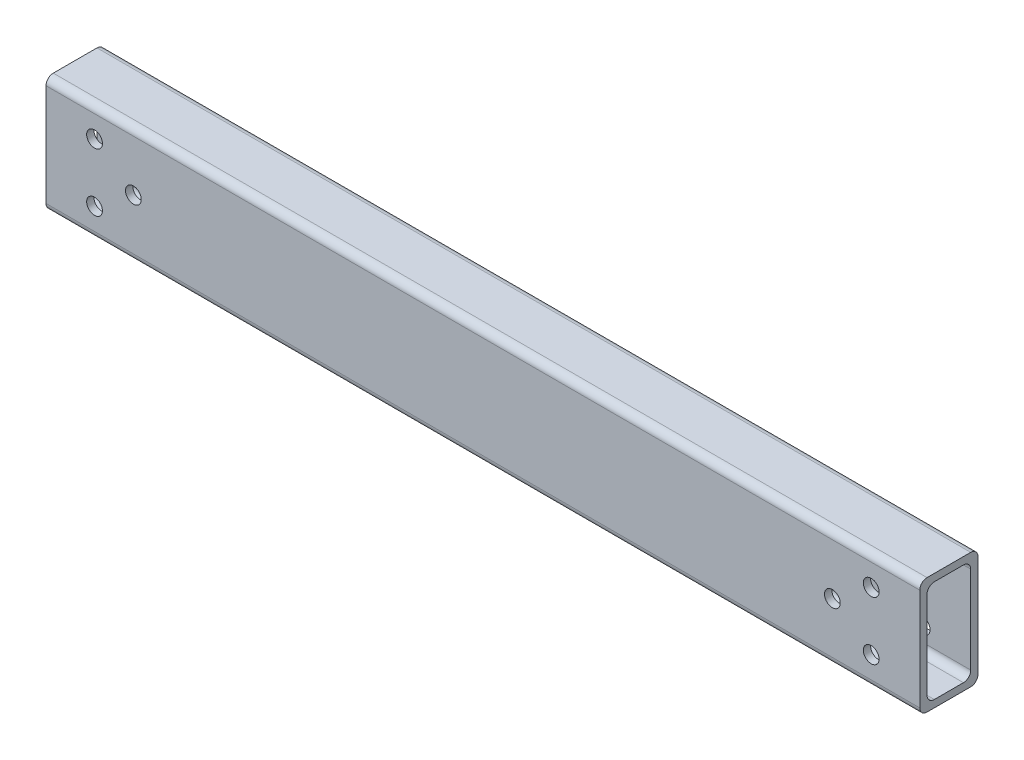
ISO-10303-21;
HEADER;
FILE_DESCRIPTION(('STEP AP214'),'2;1');
FILE_NAME('part.step','',(''),(''),'','','');
FILE_SCHEMA(('AUTOMOTIVE_DESIGN { 1 0 10303 214 1 1 1 1 }'));
ENDSEC;
DATA;
#1=APPLICATION_CONTEXT('core data for automotive mechanical design processes');
#2=APPLICATION_PROTOCOL_DEFINITION('international standard','automotive_design',2000,#1);
#3=PRODUCT_CONTEXT('',#1,'mechanical');
#4=PRODUCT('Part','Part','',(#3));
#5=PRODUCT_RELATED_PRODUCT_CATEGORY('part','',(#4));
#6=PRODUCT_DEFINITION_FORMATION('','',#4);
#7=PRODUCT_DEFINITION_CONTEXT('part definition',#1,'design');
#8=PRODUCT_DEFINITION('design','',#6,#7);
#9=PRODUCT_DEFINITION_SHAPE('','',#8);
#10=(LENGTH_UNIT() NAMED_UNIT(*) SI_UNIT(.MILLI.,.METRE.));
#11=(NAMED_UNIT(*) PLANE_ANGLE_UNIT() SI_UNIT($,.RADIAN.));
#12=(NAMED_UNIT(*) SI_UNIT($,.STERADIAN.) SOLID_ANGLE_UNIT());
#13=UNCERTAINTY_MEASURE_WITH_UNIT(LENGTH_MEASURE(1.E-05),#10,'distance_accuracy_value','');
#14=(GEOMETRIC_REPRESENTATION_CONTEXT(3) GLOBAL_UNCERTAINTY_ASSIGNED_CONTEXT((#13)) GLOBAL_UNIT_ASSIGNED_CONTEXT((#10,
#11,#12)) REPRESENTATION_CONTEXT('',''));
#15=CARTESIAN_POINT('',(0.,0.,0.));
#16=DIRECTION('',(0.,0.,1.));
#17=DIRECTION('',(1.,0.,0.));
#18=AXIS2_PLACEMENT_3D('',#15,#16,#17);
#19=CARTESIAN_POINT('',(0.,0.,76.2));
#20=DIRECTION('',(0.,0.,-1.));
#21=DIRECTION('',(-1.,0.,0.));
#22=AXIS2_PLACEMENT_3D('',#19,#20,#21);
#23=PLANE('',#22);
#24=CARTESIAN_POINT('',(-1079.5,-38.1,76.2));
#25=DIRECTION('',(0.,0.,1.));
#26=DIRECTION('',(1.,0.,0.));
#27=AXIS2_PLACEMENT_3D('',#24,#25,#26);
#28=CIRCLE('',#27,10.31875);
#29=CARTESIAN_POINT('',(-1089.81875,-38.1,76.2));
#30=VERTEX_POINT('',#29);
#31=EDGE_CURVE('E282',#30,#30,#28,.T.);
#32=ORIENTED_EDGE('',*,*,#31,.F.);
#33=EDGE_LOOP('',(#32));
#34=FACE_BOUND('',#33,.T.);
#35=CARTESIAN_POINT('',(-114.3,-76.2,76.2));
#36=DIRECTION('',(0.,0.,-1.));
#37=DIRECTION('',(-1.,0.,0.));
#38=AXIS2_PLACEMENT_3D('',#35,#36,#37);
#39=CIRCLE('',#38,10.31875);
#40=CARTESIAN_POINT('',(-124.61875,-76.2,76.2));
#41=VERTEX_POINT('',#40);
#42=EDGE_CURVE('E278',#41,#41,#39,.T.);
#43=ORIENTED_EDGE('',*,*,#42,.T.);
#44=EDGE_LOOP('',(#43));
#45=FACE_BOUND('',#44,.T.);
#46=DIRECTION('',(0.,1.,0.));
#47=VECTOR('',#46,1.);
#48=CARTESIAN_POINT('',(0.,0.,76.2));
#49=LINE('',#48,#47);
#50=CARTESIAN_POINT('',(0.,-142.875,76.2));
#51=VERTEX_POINT('',#50);
#52=CARTESIAN_POINT('',(0.,-9.525,76.2));
#53=VERTEX_POINT('',#52);
#54=EDGE_CURVE('E186',#51,#53,#49,.T.);
#55=ORIENTED_EDGE('',*,*,#54,.T.);
#56=DIRECTION('',(-1.,0.,0.));
#57=VECTOR('',#56,1.);
#58=CARTESIAN_POINT('',(0.,-9.525,76.2));
#59=LINE('',#58,#57);
#60=CARTESIAN_POINT('',(-1143.,-9.52500000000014,76.2));
#61=VERTEX_POINT('',#60);
#62=EDGE_CURVE('E158',#53,#61,#59,.T.);
#63=ORIENTED_EDGE('',*,*,#62,.T.);
#64=DIRECTION('',(0.,-1.,0.));
#65=VECTOR('',#64,1.);
#66=CARTESIAN_POINT('',(-1143.,-1.39972506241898E-13,76.2));
#67=LINE('',#66,#65);
#68=CARTESIAN_POINT('',(-1143.,-142.875,76.2));
#69=VERTEX_POINT('',#68);
#70=EDGE_CURVE('E189',#61,#69,#67,.T.);
#71=ORIENTED_EDGE('',*,*,#70,.T.);
#72=DIRECTION('',(1.,0.,0.));
#73=VECTOR('',#72,1.);
#74=CARTESIAN_POINT('',(0.,-142.875,76.2));
#75=LINE('',#74,#73);
#76=EDGE_CURVE('E250',#69,#51,#75,.T.);
#77=ORIENTED_EDGE('',*,*,#76,.T.);
#78=EDGE_LOOP('',(#55,#63,#71,#77));
#79=FACE_BOUND('',#78,.T.);
#80=CARTESIAN_POINT('',(-63.5,-38.1,76.2));
#81=DIRECTION('',(0.,0.,-1.));
#82=DIRECTION('',(-1.,0.,0.));
#83=AXIS2_PLACEMENT_3D('',#80,#81,#82);
#84=CIRCLE('',#83,10.31875);
#85=CARTESIAN_POINT('',(-73.81875,-38.1,76.2));
#86=VERTEX_POINT('',#85);
#87=EDGE_CURVE('E268',#86,#86,#84,.T.);
#88=ORIENTED_EDGE('',*,*,#87,.T.);
#89=EDGE_LOOP('',(#88));
#90=FACE_BOUND('',#89,.T.);
#91=CARTESIAN_POINT('',(-63.5,-114.3,76.2));
#92=DIRECTION('',(0.,0.,1.));
#93=DIRECTION('',(-1.,0.,0.));
#94=AXIS2_PLACEMENT_3D('',#91,#92,#93);
#95=CIRCLE('',#94,10.31875);
#96=CARTESIAN_POINT('',(-73.81875,-114.3,76.2));
#97=VERTEX_POINT('',#96);
#98=EDGE_CURVE('E273',#97,#97,#95,.T.);
#99=ORIENTED_EDGE('',*,*,#98,.F.);
#100=EDGE_LOOP('',(#99));
#101=FACE_BOUND('',#100,.T.);
#102=CARTESIAN_POINT('',(-1079.5,-114.3,76.2));
#103=DIRECTION('',(0.,0.,-1.));
#104=DIRECTION('',(1.,0.,0.));
#105=AXIS2_PLACEMENT_3D('',#102,#103,#104);
#106=CIRCLE('',#105,10.31875);
#107=CARTESIAN_POINT('',(-1089.81875,-114.3,76.2));
#108=VERTEX_POINT('',#107);
#109=EDGE_CURVE('E286',#108,#108,#106,.T.);
#110=ORIENTED_EDGE('',*,*,#109,.T.);
#111=EDGE_LOOP('',(#110));
#112=FACE_BOUND('',#111,.T.);
#113=CARTESIAN_POINT('',(-1028.7,-76.2,76.2));
#114=DIRECTION('',(0.,0.,1.));
#115=DIRECTION('',(1.,0.,0.));
#116=AXIS2_PLACEMENT_3D('',#113,#114,#115);
#117=CIRCLE('',#116,10.31875);
#118=CARTESIAN_POINT('',(-1039.01875,-76.2,76.2));
#119=VERTEX_POINT('',#118);
#120=EDGE_CURVE('E364',#119,#119,#117,.T.);
#121=ORIENTED_EDGE('',*,*,#120,.F.);
#122=EDGE_LOOP('',(#121));
#123=FACE_BOUND('',#122,.T.);
#124=ADVANCED_FACE('F31',(#34,#45,#79,#90,#101,#112,#123),#23,.F.);
#125=CARTESIAN_POINT('',(0.,0.,0.));
#126=DIRECTION('',(0.,0.,-1.));
#127=DIRECTION('',(-1.,0.,0.));
#128=AXIS2_PLACEMENT_3D('',#125,#126,#127);
#129=PLANE('',#128);
#130=CARTESIAN_POINT('',(-1079.5,-38.1,0.));
#131=DIRECTION('',(0.,0.,1.));
#132=DIRECTION('',(1.,0.,0.));
#133=AXIS2_PLACEMENT_3D('',#130,#131,#132);
#134=CIRCLE('',#133,10.31875);
#135=CARTESIAN_POINT('',(-1089.81875,-38.1,0.));
#136=VERTEX_POINT('',#135);
#137=EDGE_CURVE('E290',#136,#136,#134,.T.);
#138=ORIENTED_EDGE('',*,*,#137,.T.);
#139=EDGE_LOOP('',(#138));
#140=FACE_BOUND('',#139,.T.);
#141=CARTESIAN_POINT('',(-114.3,-76.2,0.));
#142=DIRECTION('',(0.,0.,-1.));
#143=DIRECTION('',(-1.,0.,0.));
#144=AXIS2_PLACEMENT_3D('',#141,#142,#143);
#145=CIRCLE('',#144,10.31875);
#146=CARTESIAN_POINT('',(-124.61875,-76.2,0.));
#147=VERTEX_POINT('',#146);
#148=EDGE_CURVE('E309',#147,#147,#145,.T.);
#149=ORIENTED_EDGE('',*,*,#148,.F.);
#150=EDGE_LOOP('',(#149));
#151=FACE_BOUND('',#150,.T.);
#152=DIRECTION('',(0.,1.,0.));
#153=VECTOR('',#152,1.);
#154=CARTESIAN_POINT('',(0.,0.,0.));
#155=LINE('',#154,#153);
#156=CARTESIAN_POINT('',(0.,-142.875,0.));
#157=VERTEX_POINT('',#156);
#158=CARTESIAN_POINT('',(0.,-9.525,0.));
#159=VERTEX_POINT('',#158);
#160=EDGE_CURVE('E194',#157,#159,#155,.T.);
#161=ORIENTED_EDGE('',*,*,#160,.F.);
#162=DIRECTION('',(1.,0.,0.));
#163=VECTOR('',#162,1.);
#164=CARTESIAN_POINT('',(-1143.,-142.875,0.));
#165=LINE('',#164,#163);
#166=CARTESIAN_POINT('',(-1143.,-142.875,0.));
#167=VERTEX_POINT('',#166);
#168=EDGE_CURVE('E238',#157,#167,#165,.F.);
#169=ORIENTED_EDGE('',*,*,#168,.T.);
#170=DIRECTION('',(0.,-1.,0.));
#171=VECTOR('',#170,1.);
#172=CARTESIAN_POINT('',(-1143.,-1.39972506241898E-13,0.));
#173=LINE('',#172,#171);
#174=CARTESIAN_POINT('',(-1143.,-9.52500000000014,0.));
#175=VERTEX_POINT('',#174);
#176=EDGE_CURVE('E190',#175,#167,#173,.T.);
#177=ORIENTED_EDGE('',*,*,#176,.F.);
#178=DIRECTION('',(-1.,0.,0.));
#179=VECTOR('',#178,1.);
#180=CARTESIAN_POINT('',(0.,-9.525,0.));
#181=LINE('',#180,#179);
#182=EDGE_CURVE('E236',#175,#159,#181,.F.);
#183=ORIENTED_EDGE('',*,*,#182,.T.);
#184=EDGE_LOOP('',(#161,#169,#177,#183));
#185=FACE_BOUND('',#184,.T.);
#186=CARTESIAN_POINT('',(-63.5,-38.1,0.));
#187=DIRECTION('',(0.,0.,-1.));
#188=DIRECTION('',(-1.,0.,0.));
#189=AXIS2_PLACEMENT_3D('',#186,#187,#188);
#190=CIRCLE('',#189,10.31875);
#191=CARTESIAN_POINT('',(-73.81875,-38.1,0.));
#192=VERTEX_POINT('',#191);
#193=EDGE_CURVE('E323',#192,#192,#190,.T.);
#194=ORIENTED_EDGE('',*,*,#193,.F.);
#195=EDGE_LOOP('',(#194));
#196=FACE_BOUND('',#195,.T.);
#197=CARTESIAN_POINT('',(-63.5,-114.3,0.));
#198=DIRECTION('',(0.,0.,1.));
#199=DIRECTION('',(-1.,0.,0.));
#200=AXIS2_PLACEMENT_3D('',#197,#198,#199);
#201=CIRCLE('',#200,10.31875);
#202=CARTESIAN_POINT('',(-73.81875,-114.3,0.));
#203=VERTEX_POINT('',#202);
#204=EDGE_CURVE('E316',#203,#203,#201,.T.);
#205=ORIENTED_EDGE('',*,*,#204,.T.);
#206=EDGE_LOOP('',(#205));
#207=FACE_BOUND('',#206,.T.);
#208=CARTESIAN_POINT('',(-1079.5,-114.3,0.));
#209=DIRECTION('',(0.,0.,-1.));
#210=DIRECTION('',(1.,0.,0.));
#211=AXIS2_PLACEMENT_3D('',#208,#209,#210);
#212=CIRCLE('',#211,10.31875);
#213=CARTESIAN_POINT('',(-1089.81875,-114.3,0.));
#214=VERTEX_POINT('',#213);
#215=EDGE_CURVE('E293',#214,#214,#212,.T.);
#216=ORIENTED_EDGE('',*,*,#215,.F.);
#217=EDGE_LOOP('',(#216));
#218=FACE_BOUND('',#217,.T.);
#219=CARTESIAN_POINT('',(-1028.7,-76.2,0.));
#220=DIRECTION('',(0.,0.,1.));
#221=DIRECTION('',(1.,0.,0.));
#222=AXIS2_PLACEMENT_3D('',#219,#220,#221);
#223=CIRCLE('',#222,10.31875);
#224=CARTESIAN_POINT('',(-1039.01875,-76.2,0.));
#225=VERTEX_POINT('',#224);
#226=EDGE_CURVE('E367',#225,#225,#223,.T.);
#227=ORIENTED_EDGE('',*,*,#226,.T.);
#228=EDGE_LOOP('',(#227));
#229=FACE_BOUND('',#228,.T.);
#230=ADVANCED_FACE('F374',(#140,#151,#185,#196,#207,#218,#229),#129,.T.);
#231=CARTESIAN_POINT('',(-1143.,-9.52500000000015,66.675));
#232=DIRECTION('',(0.,0.,1.));
#233=DIRECTION('',(0.,-1.,0.));
#234=AXIS2_PLACEMENT_3D('',#231,#232,#233);
#235=PLANE('',#234);
#236=CARTESIAN_POINT('',(-1079.5,-38.1,66.675));
#237=DIRECTION('',(0.,0.,1.));
#238=DIRECTION('',(0.,-1.,0.));
#239=AXIS2_PLACEMENT_3D('',#236,#237,#238);
#240=CIRCLE('',#239,10.31875);
#241=CARTESIAN_POINT('',(-1089.81875,-38.1,66.675));
#242=VERTEX_POINT('',#241);
#243=EDGE_CURVE('E281',#242,#242,#240,.F.);
#244=ORIENTED_EDGE('',*,*,#243,.F.);
#245=EDGE_LOOP('',(#244));
#246=FACE_BOUND('',#245,.T.);
#247=CARTESIAN_POINT('',(-114.3,-76.2,66.675));
#248=DIRECTION('',(0.,0.,1.));
#249=DIRECTION('',(0.,-1.,0.));
#250=AXIS2_PLACEMENT_3D('',#247,#248,#249);
#251=CIRCLE('',#250,10.31875);
#252=CARTESIAN_POINT('',(-124.61875,-76.2,66.675));
#253=VERTEX_POINT('',#252);
#254=EDGE_CURVE('E277',#253,#253,#251,.T.);
#255=ORIENTED_EDGE('',*,*,#254,.T.);
#256=EDGE_LOOP('',(#255));
#257=FACE_BOUND('',#256,.T.);
#258=DIRECTION('',(0.,-1.,0.));
#259=VECTOR('',#258,1.);
#260=CARTESIAN_POINT('',(-1143.,-9.52500000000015,66.675));
#261=LINE('',#260,#259);
#262=CARTESIAN_POINT('',(-1143.,-19.0500000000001,66.675));
#263=VERTEX_POINT('',#262);
#264=CARTESIAN_POINT('',(-1143.,-133.35,66.675));
#265=VERTEX_POINT('',#264);
#266=EDGE_CURVE('E176',#263,#265,#261,.T.);
#267=ORIENTED_EDGE('',*,*,#266,.F.);
#268=DIRECTION('',(1.,0.,0.));
#269=VECTOR('',#268,1.);
#270=CARTESIAN_POINT('',(0.,-19.05,66.675));
#271=LINE('',#270,#269);
#272=CARTESIAN_POINT('',(0.,-19.05,66.675));
#273=VERTEX_POINT('',#272);
#274=EDGE_CURVE('E215',#263,#273,#271,.T.);
#275=ORIENTED_EDGE('',*,*,#274,.T.);
#276=DIRECTION('',(0.,-1.,0.));
#277=VECTOR('',#276,1.);
#278=CARTESIAN_POINT('',(0.,-9.52500000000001,66.675));
#279=LINE('',#278,#277);
#280=CARTESIAN_POINT('',(0.,-133.35,66.675));
#281=VERTEX_POINT('',#280);
#282=EDGE_CURVE('E329',#273,#281,#279,.T.);
#283=ORIENTED_EDGE('',*,*,#282,.T.);
#284=DIRECTION('',(1.,0.,0.));
#285=VECTOR('',#284,1.);
#286=CARTESIAN_POINT('',(-1143.,-133.35,66.675));
#287=LINE('',#286,#285);
#288=EDGE_CURVE('E213',#281,#265,#287,.F.);
#289=ORIENTED_EDGE('',*,*,#288,.T.);
#290=EDGE_LOOP('',(#267,#275,#283,#289));
#291=FACE_BOUND('',#290,.T.);
#292=CARTESIAN_POINT('',(-63.5,-38.1,66.675));
#293=DIRECTION('',(0.,0.,1.));
#294=DIRECTION('',(0.,-1.,0.));
#295=AXIS2_PLACEMENT_3D('',#292,#293,#294);
#296=CIRCLE('',#295,10.31875);
#297=CARTESIAN_POINT('',(-73.81875,-38.1,66.675));
#298=VERTEX_POINT('',#297);
#299=EDGE_CURVE('E267',#298,#298,#296,.T.);
#300=ORIENTED_EDGE('',*,*,#299,.T.);
#301=EDGE_LOOP('',(#300));
#302=FACE_BOUND('',#301,.T.);
#303=CARTESIAN_POINT('',(-63.5,-114.3,66.675));
#304=DIRECTION('',(0.,0.,1.));
#305=DIRECTION('',(0.,-1.,0.));
#306=AXIS2_PLACEMENT_3D('',#303,#304,#305);
#307=CIRCLE('',#306,10.31875);
#308=CARTESIAN_POINT('',(-73.81875,-114.3,66.675));
#309=VERTEX_POINT('',#308);
#310=EDGE_CURVE('E272',#309,#309,#307,.F.);
#311=ORIENTED_EDGE('',*,*,#310,.F.);
#312=EDGE_LOOP('',(#311));
#313=FACE_BOUND('',#312,.T.);
#314=CARTESIAN_POINT('',(-1079.5,-114.3,66.675));
#315=DIRECTION('',(0.,0.,1.));
#316=DIRECTION('',(0.,-1.,0.));
#317=AXIS2_PLACEMENT_3D('',#314,#315,#316);
#318=CIRCLE('',#317,10.31875);
#319=CARTESIAN_POINT('',(-1089.81875,-114.3,66.675));
#320=VERTEX_POINT('',#319);
#321=EDGE_CURVE('E285',#320,#320,#318,.T.);
#322=ORIENTED_EDGE('',*,*,#321,.T.);
#323=EDGE_LOOP('',(#322));
#324=FACE_BOUND('',#323,.T.);
#325=CARTESIAN_POINT('',(-1028.7,-76.2,66.675));
#326=DIRECTION('',(0.,0.,1.));
#327=DIRECTION('',(0.,-1.,0.));
#328=AXIS2_PLACEMENT_3D('',#325,#326,#327);
#329=CIRCLE('',#328,10.31875);
#330=CARTESIAN_POINT('',(-1039.01875,-76.2,66.675));
#331=VERTEX_POINT('',#330);
#332=EDGE_CURVE('E298',#331,#331,#329,.F.);
#333=ORIENTED_EDGE('',*,*,#332,.F.);
#334=EDGE_LOOP('',(#333));
#335=FACE_BOUND('',#334,.T.);
#336=ADVANCED_FACE('F354',(#246,#257,#291,#302,#313,#324,#335),#235,.F.);
#337=CARTESIAN_POINT('',(-1143.,-9.52500000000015,9.52500000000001));
#338=DIRECTION('',(0.,0.,-1.));
#339=DIRECTION('',(0.,1.,0.));
#340=AXIS2_PLACEMENT_3D('',#337,#338,#339);
#341=PLANE('',#340);
#342=CARTESIAN_POINT('',(-1079.5,-38.1,9.52500000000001));
#343=DIRECTION('',(0.,0.,-1.));
#344=DIRECTION('',(0.,1.,0.));
#345=AXIS2_PLACEMENT_3D('',#342,#343,#344);
#346=CIRCLE('',#345,10.31875);
#347=CARTESIAN_POINT('',(-1089.81875,-38.1,9.52500000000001));
#348=VERTEX_POINT('',#347);
#349=EDGE_CURVE('E279',#348,#348,#346,.F.);
#350=ORIENTED_EDGE('',*,*,#349,.F.);
#351=EDGE_LOOP('',(#350));
#352=FACE_BOUND('',#351,.T.);
#353=CARTESIAN_POINT('',(-114.3,-76.2,9.52500000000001));
#354=DIRECTION('',(0.,0.,-1.));
#355=DIRECTION('',(0.,1.,0.));
#356=AXIS2_PLACEMENT_3D('',#353,#354,#355);
#357=CIRCLE('',#356,10.31875);
#358=CARTESIAN_POINT('',(-124.61875,-76.2,9.52500000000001));
#359=VERTEX_POINT('',#358);
#360=EDGE_CURVE('E274',#359,#359,#357,.T.);
#361=ORIENTED_EDGE('',*,*,#360,.T.);
#362=EDGE_LOOP('',(#361));
#363=FACE_BOUND('',#362,.T.);
#364=DIRECTION('',(0.,1.,0.));
#365=VECTOR('',#364,1.);
#366=CARTESIAN_POINT('',(0.,-9.52500000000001,9.52500000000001));
#367=LINE('',#366,#365);
#368=CARTESIAN_POINT('',(0.,-133.35,9.52499999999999));
#369=VERTEX_POINT('',#368);
#370=CARTESIAN_POINT('',(0.,-19.05,9.525));
#371=VERTEX_POINT('',#370);
#372=EDGE_CURVE('E177',#369,#371,#367,.T.);
#373=ORIENTED_EDGE('',*,*,#372,.T.);
#374=DIRECTION('',(1.,0.,0.));
#375=VECTOR('',#374,1.);
#376=CARTESIAN_POINT('',(-1143.,-19.0500000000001,9.525));
#377=LINE('',#376,#375);
#378=CARTESIAN_POINT('',(-1143.,-19.0500000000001,9.525));
#379=VERTEX_POINT('',#378);
#380=EDGE_CURVE('E152',#371,#379,#377,.F.);
#381=ORIENTED_EDGE('',*,*,#380,.T.);
#382=DIRECTION('',(0.,1.,0.));
#383=VECTOR('',#382,1.);
#384=CARTESIAN_POINT('',(-1143.,-9.52500000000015,9.52500000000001));
#385=LINE('',#384,#383);
#386=CARTESIAN_POINT('',(-1143.,-133.35,9.52499999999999));
#387=VERTEX_POINT('',#386);
#388=EDGE_CURVE('E333',#387,#379,#385,.T.);
#389=ORIENTED_EDGE('',*,*,#388,.F.);
#390=DIRECTION('',(1.,0.,0.));
#391=VECTOR('',#390,1.);
#392=CARTESIAN_POINT('',(0.,-133.35,9.52499999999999));
#393=LINE('',#392,#391);
#394=EDGE_CURVE('E168',#387,#369,#393,.T.);
#395=ORIENTED_EDGE('',*,*,#394,.T.);
#396=EDGE_LOOP('',(#373,#381,#389,#395));
#397=FACE_BOUND('',#396,.T.);
#398=CARTESIAN_POINT('',(-63.5,-38.1,9.52500000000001));
#399=DIRECTION('',(0.,0.,-1.));
#400=DIRECTION('',(0.,1.,0.));
#401=AXIS2_PLACEMENT_3D('',#398,#399,#400);
#402=CIRCLE('',#401,10.31875);
#403=CARTESIAN_POINT('',(-73.81875,-38.1,9.52500000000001));
#404=VERTEX_POINT('',#403);
#405=EDGE_CURVE('E264',#404,#404,#402,.T.);
#406=ORIENTED_EDGE('',*,*,#405,.T.);
#407=EDGE_LOOP('',(#406));
#408=FACE_BOUND('',#407,.T.);
#409=CARTESIAN_POINT('',(-63.5,-114.3,9.52499999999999));
#410=DIRECTION('',(0.,0.,-1.));
#411=DIRECTION('',(0.,1.,0.));
#412=AXIS2_PLACEMENT_3D('',#409,#410,#411);
#413=CIRCLE('',#412,10.31875);
#414=CARTESIAN_POINT('',(-73.81875,-114.3,9.52500000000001));
#415=VERTEX_POINT('',#414);
#416=EDGE_CURVE('E269',#415,#415,#413,.F.);
#417=ORIENTED_EDGE('',*,*,#416,.F.);
#418=EDGE_LOOP('',(#417));
#419=FACE_BOUND('',#418,.T.);
#420=CARTESIAN_POINT('',(-1079.5,-114.3,9.52499999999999));
#421=DIRECTION('',(0.,0.,-1.));
#422=DIRECTION('',(0.,1.,0.));
#423=AXIS2_PLACEMENT_3D('',#420,#421,#422);
#424=CIRCLE('',#423,10.31875);
#425=CARTESIAN_POINT('',(-1089.81875,-114.3,9.52500000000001));
#426=VERTEX_POINT('',#425);
#427=EDGE_CURVE('E283',#426,#426,#424,.T.);
#428=ORIENTED_EDGE('',*,*,#427,.T.);
#429=EDGE_LOOP('',(#428));
#430=FACE_BOUND('',#429,.T.);
#431=CARTESIAN_POINT('',(-1028.7,-76.2,9.52500000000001));
#432=DIRECTION('',(0.,0.,-1.));
#433=DIRECTION('',(0.,1.,0.));
#434=AXIS2_PLACEMENT_3D('',#431,#432,#433);
#435=CIRCLE('',#434,10.31875);
#436=CARTESIAN_POINT('',(-1039.01875,-76.2,9.52500000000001));
#437=VERTEX_POINT('',#436);
#438=EDGE_CURVE('E35',#437,#437,#435,.F.);
#439=ORIENTED_EDGE('',*,*,#438,.F.);
#440=EDGE_LOOP('',(#439));
#441=FACE_BOUND('',#440,.T.);
#442=ADVANCED_FACE('F351',(#352,#363,#397,#408,#419,#430,#441),#341,.F.);
#443=CARTESIAN_POINT('',(0.,0.,76.2));
#444=DIRECTION('',(-1.,0.,0.));
#445=DIRECTION('',(0.,-1.,0.));
#446=AXIS2_PLACEMENT_3D('',#443,#444,#445);
#447=PLANE('',#446);
#448=DIRECTION('',(0.,0.,-1.));
#449=VECTOR('',#448,1.);
#450=CARTESIAN_POINT('',(0.,-142.875,66.675));
#451=LINE('',#450,#449);
#452=CARTESIAN_POINT('',(0.,-142.875,57.15));
#453=VERTEX_POINT('',#452);
#454=CARTESIAN_POINT('',(0.,-142.875,19.05));
#455=VERTEX_POINT('',#454);
#456=EDGE_CURVE('E182',#453,#455,#451,.T.);
#457=ORIENTED_EDGE('',*,*,#456,.F.);
#458=CARTESIAN_POINT('',(0.,-133.35,57.15));
#459=DIRECTION('',(-1.,0.,0.));
#460=DIRECTION('',(0.,-1.,0.));
#461=AXIS2_PLACEMENT_3D('',#458,#459,#460);
#462=CIRCLE('',#461,9.525);
#463=EDGE_CURVE('E259',#453,#281,#462,.T.);
#464=ORIENTED_EDGE('',*,*,#463,.T.);
#465=ORIENTED_EDGE('',*,*,#282,.F.);
#466=CARTESIAN_POINT('',(0.,-19.05,57.15));
#467=DIRECTION('',(-1.,0.,0.));
#468=DIRECTION('',(0.,-1.,0.));
#469=AXIS2_PLACEMENT_3D('',#466,#467,#468);
#470=CIRCLE('',#469,9.525);
#471=CARTESIAN_POINT('',(0.,-9.52500000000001,57.15));
#472=VERTEX_POINT('',#471);
#473=EDGE_CURVE('E175',#273,#472,#470,.T.);
#474=ORIENTED_EDGE('',*,*,#473,.T.);
#475=DIRECTION('',(0.,0.,1.));
#476=VECTOR('',#475,1.);
#477=CARTESIAN_POINT('',(0.,-9.52500000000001,66.675));
#478=LINE('',#477,#476);
#479=CARTESIAN_POINT('',(0.,-9.52500000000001,19.05));
#480=VERTEX_POINT('',#479);
#481=EDGE_CURVE('E164',#480,#472,#478,.T.);
#482=ORIENTED_EDGE('',*,*,#481,.F.);
#483=CARTESIAN_POINT('',(0.,-19.05,19.05));
#484=DIRECTION('',(-1.,0.,0.));
#485=DIRECTION('',(0.,-1.,0.));
#486=AXIS2_PLACEMENT_3D('',#483,#484,#485);
#487=CIRCLE('',#486,9.525);
#488=EDGE_CURVE('E147',#480,#371,#487,.T.);
#489=ORIENTED_EDGE('',*,*,#488,.T.);
#490=ORIENTED_EDGE('',*,*,#372,.F.);
#491=CARTESIAN_POINT('',(0.,-133.35,19.05));
#492=DIRECTION('',(-1.,0.,0.));
#493=DIRECTION('',(0.,-1.,0.));
#494=AXIS2_PLACEMENT_3D('',#491,#492,#493);
#495=CIRCLE('',#494,9.525);
#496=EDGE_CURVE('E40',#369,#455,#495,.T.);
#497=ORIENTED_EDGE('',*,*,#496,.T.);
#498=EDGE_LOOP('',(#457,#464,#465,#474,#482,#489,#490,#497));
#499=FACE_BOUND('',#498,.T.);
#500=DIRECTION('',(0.,0.,-1.));
#501=VECTOR('',#500,1.);
#502=CARTESIAN_POINT('',(0.,-152.4,76.2));
#503=LINE('',#502,#501);
#504=CARTESIAN_POINT('',(0.,-152.4,66.675));
#505=VERTEX_POINT('',#504);
#506=CARTESIAN_POINT('',(0.,-152.4,9.52500000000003));
#507=VERTEX_POINT('',#506);
#508=EDGE_CURVE('E193',#505,#507,#503,.T.);
#509=ORIENTED_EDGE('',*,*,#508,.T.);
#510=CARTESIAN_POINT('',(0.,-142.875,9.52500000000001));
#511=DIRECTION('',(-1.,0.,0.));
#512=DIRECTION('',(0.,-1.,0.));
#513=AXIS2_PLACEMENT_3D('',#510,#511,#512);
#514=CIRCLE('',#513,9.525);
#515=EDGE_CURVE('E234',#507,#157,#514,.F.);
#516=ORIENTED_EDGE('',*,*,#515,.T.);
#517=ORIENTED_EDGE('',*,*,#160,.T.);
#518=CARTESIAN_POINT('',(0.,-9.525,9.52500000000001));
#519=DIRECTION('',(-1.,0.,0.));
#520=DIRECTION('',(0.,-1.,0.));
#521=AXIS2_PLACEMENT_3D('',#518,#519,#520);
#522=CIRCLE('',#521,9.525);
#523=CARTESIAN_POINT('',(0.,0.,9.52500000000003));
#524=VERTEX_POINT('',#523);
#525=EDGE_CURVE('E232',#159,#524,#522,.F.);
#526=ORIENTED_EDGE('',*,*,#525,.T.);
#527=DIRECTION('',(0.,0.,-1.));
#528=VECTOR('',#527,1.);
#529=CARTESIAN_POINT('',(0.,0.,76.2));
#530=LINE('',#529,#528);
#531=CARTESIAN_POINT('',(0.,0.,66.675));
#532=VERTEX_POINT('',#531);
#533=EDGE_CURVE('E206',#532,#524,#530,.T.);
#534=ORIENTED_EDGE('',*,*,#533,.F.);
#535=CARTESIAN_POINT('',(0.,-9.525,66.675));
#536=DIRECTION('',(-1.,0.,0.));
#537=DIRECTION('',(0.,-1.,0.));
#538=AXIS2_PLACEMENT_3D('',#535,#536,#537);
#539=CIRCLE('',#538,9.525);
#540=EDGE_CURVE('E230',#532,#53,#539,.F.);
#541=ORIENTED_EDGE('',*,*,#540,.T.);
#542=ORIENTED_EDGE('',*,*,#54,.F.);
#543=CARTESIAN_POINT('',(0.,-142.875,66.675));
#544=DIRECTION('',(-1.,0.,0.));
#545=DIRECTION('',(0.,-1.,0.));
#546=AXIS2_PLACEMENT_3D('',#543,#544,#545);
#547=CIRCLE('',#546,9.525);
#548=EDGE_CURVE('E228',#51,#505,#547,.F.);
#549=ORIENTED_EDGE('',*,*,#548,.T.);
#550=EDGE_LOOP('',(#509,#516,#517,#526,#534,#541,#542,#549));
#551=FACE_BOUND('',#550,.T.);
#552=ADVANCED_FACE('F172',(#499,#551),#447,.F.);
#553=CARTESIAN_POINT('',(0.,0.,76.2));
#554=DIRECTION('',(0.,-1.,0.));
#555=DIRECTION('',(1.,0.,0.));
#556=AXIS2_PLACEMENT_3D('',#553,#554,#555);
#557=PLANE('',#556);
#558=ORIENTED_EDGE('',*,*,#533,.T.);
#559=DIRECTION('',(-1.,0.,0.));
#560=VECTOR('',#559,1.);
#561=CARTESIAN_POINT('',(-1143.,-1.39972506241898E-13,9.52500000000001));
#562=LINE('',#561,#560);
#563=CARTESIAN_POINT('',(-1143.,-1.39972506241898E-13,9.52500000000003));
#564=VERTEX_POINT('',#563);
#565=EDGE_CURVE('E248',#524,#564,#562,.T.);
#566=ORIENTED_EDGE('',*,*,#565,.T.);
#567=DIRECTION('',(0.,0.,-1.));
#568=VECTOR('',#567,1.);
#569=CARTESIAN_POINT('',(-1143.,-1.39972506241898E-13,76.2));
#570=LINE('',#569,#568);
#571=CARTESIAN_POINT('',(-1143.,-1.39972506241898E-13,66.675));
#572=VERTEX_POINT('',#571);
#573=EDGE_CURVE('E204',#572,#564,#570,.T.);
#574=ORIENTED_EDGE('',*,*,#573,.F.);
#575=DIRECTION('',(-1.,0.,0.));
#576=VECTOR('',#575,1.);
#577=CARTESIAN_POINT('',(0.,0.,66.675));
#578=LINE('',#577,#576);
#579=EDGE_CURVE('E246',#572,#532,#578,.F.);
#580=ORIENTED_EDGE('',*,*,#579,.T.);
#581=EDGE_LOOP('',(#558,#566,#574,#580));
#582=FACE_BOUND('',#581,.T.);
#583=ADVANCED_FACE('F407',(#582),#557,.F.);
#584=CARTESIAN_POINT('',(-1143.,-1.39972506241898E-13,76.2));
#585=DIRECTION('',(1.,0.,0.));
#586=DIRECTION('',(0.,0.,-1.));
#587=AXIS2_PLACEMENT_3D('',#584,#585,#586);
#588=PLANE('',#587);
#589=ORIENTED_EDGE('',*,*,#388,.T.);
#590=CARTESIAN_POINT('',(-1143.,-19.0500000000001,19.05));
#591=DIRECTION('',(1.,0.,0.));
#592=DIRECTION('',(0.,0.,-1.));
#593=AXIS2_PLACEMENT_3D('',#590,#591,#592);
#594=CIRCLE('',#593,9.525);
#595=CARTESIAN_POINT('',(-1143.,-9.52500000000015,19.05));
#596=VERTEX_POINT('',#595);
#597=EDGE_CURVE('E157',#379,#596,#594,.T.);
#598=ORIENTED_EDGE('',*,*,#597,.T.);
#599=DIRECTION('',(0.,0.,1.));
#600=VECTOR('',#599,1.);
#601=CARTESIAN_POINT('',(-1143.,-9.52500000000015,66.675));
#602=LINE('',#601,#600);
#603=CARTESIAN_POINT('',(-1143.,-9.52500000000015,57.15));
#604=VERTEX_POINT('',#603);
#605=EDGE_CURVE('E167',#596,#604,#602,.T.);
#606=ORIENTED_EDGE('',*,*,#605,.T.);
#607=CARTESIAN_POINT('',(-1143.,-19.0500000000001,57.15));
#608=DIRECTION('',(1.,0.,0.));
#609=DIRECTION('',(0.,0.,-1.));
#610=AXIS2_PLACEMENT_3D('',#607,#608,#609);
#611=CIRCLE('',#610,9.525);
#612=EDGE_CURVE('E257',#604,#263,#611,.T.);
#613=ORIENTED_EDGE('',*,*,#612,.T.);
#614=ORIENTED_EDGE('',*,*,#266,.T.);
#615=CARTESIAN_POINT('',(-1143.,-133.35,57.15));
#616=DIRECTION('',(1.,0.,0.));
#617=DIRECTION('',(0.,0.,-1.));
#618=AXIS2_PLACEMENT_3D('',#615,#616,#617);
#619=CIRCLE('',#618,9.525);
#620=CARTESIAN_POINT('',(-1143.,-142.875,57.15));
#621=VERTEX_POINT('',#620);
#622=EDGE_CURVE('E261',#265,#621,#619,.T.);
#623=ORIENTED_EDGE('',*,*,#622,.T.);
#624=DIRECTION('',(0.,0.,-1.));
#625=VECTOR('',#624,1.);
#626=CARTESIAN_POINT('',(-1143.,-142.875,66.675));
#627=LINE('',#626,#625);
#628=CARTESIAN_POINT('',(-1143.,-142.875,19.05));
#629=VERTEX_POINT('',#628);
#630=EDGE_CURVE('E180',#621,#629,#627,.T.);
#631=ORIENTED_EDGE('',*,*,#630,.T.);
#632=CARTESIAN_POINT('',(-1143.,-133.35,19.05));
#633=DIRECTION('',(1.,0.,0.));
#634=DIRECTION('',(0.,0.,-1.));
#635=AXIS2_PLACEMENT_3D('',#632,#633,#634);
#636=CIRCLE('',#635,9.525);
#637=EDGE_CURVE('E11',#629,#387,#636,.T.);
#638=ORIENTED_EDGE('',*,*,#637,.T.);
#639=EDGE_LOOP('',(#589,#598,#606,#613,#614,#623,#631,#638));
#640=FACE_BOUND('',#639,.T.);
#641=ORIENTED_EDGE('',*,*,#176,.T.);
#642=CARTESIAN_POINT('',(-1143.,-142.875,9.52500000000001));
#643=DIRECTION('',(1.,0.,0.));
#644=DIRECTION('',(0.,0.,-1.));
#645=AXIS2_PLACEMENT_3D('',#642,#643,#644);
#646=CIRCLE('',#645,9.525);
#647=CARTESIAN_POINT('',(-1143.,-152.4,9.52500000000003));
#648=VERTEX_POINT('',#647);
#649=EDGE_CURVE('E244',#167,#648,#646,.F.);
#650=ORIENTED_EDGE('',*,*,#649,.T.);
#651=DIRECTION('',(0.,0.,-1.));
#652=VECTOR('',#651,1.);
#653=CARTESIAN_POINT('',(-1143.,-152.4,76.2));
#654=LINE('',#653,#652);
#655=CARTESIAN_POINT('',(-1143.,-152.4,66.675));
#656=VERTEX_POINT('',#655);
#657=EDGE_CURVE('E201',#656,#648,#654,.T.);
#658=ORIENTED_EDGE('',*,*,#657,.F.);
#659=CARTESIAN_POINT('',(-1143.,-142.875,66.675));
#660=DIRECTION('',(1.,0.,0.));
#661=DIRECTION('',(0.,0.,-1.));
#662=AXIS2_PLACEMENT_3D('',#659,#660,#661);
#663=CIRCLE('',#662,9.525);
#664=EDGE_CURVE('E240',#656,#69,#663,.F.);
#665=ORIENTED_EDGE('',*,*,#664,.T.);
#666=ORIENTED_EDGE('',*,*,#70,.F.);
#667=CARTESIAN_POINT('',(-1143.,-9.52500000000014,66.675));
#668=DIRECTION('',(1.,0.,0.));
#669=DIRECTION('',(0.,0.,-1.));
#670=AXIS2_PLACEMENT_3D('',#667,#668,#669);
#671=CIRCLE('',#670,9.525);
#672=EDGE_CURVE('E56',#61,#572,#671,.F.);
#673=ORIENTED_EDGE('',*,*,#672,.T.);
#674=ORIENTED_EDGE('',*,*,#573,.T.);
#675=CARTESIAN_POINT('',(-1143.,-9.52500000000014,9.52500000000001));
#676=DIRECTION('',(1.,0.,0.));
#677=DIRECTION('',(0.,0.,-1.));
#678=AXIS2_PLACEMENT_3D('',#675,#676,#677);
#679=CIRCLE('',#678,9.525);
#680=EDGE_CURVE('E48',#564,#175,#679,.F.);
#681=ORIENTED_EDGE('',*,*,#680,.T.);
#682=EDGE_LOOP('',(#641,#650,#658,#665,#666,#673,#674,#681));
#683=FACE_BOUND('',#682,.T.);
#684=ADVANCED_FACE('F349',(#640,#683),#588,.F.);
#685=CARTESIAN_POINT('',(0.,-152.4,76.2));
#686=DIRECTION('',(0.,1.,0.));
#687=DIRECTION('',(-1.,0.,0.));
#688=AXIS2_PLACEMENT_3D('',#685,#686,#687);
#689=PLANE('',#688);
#690=ORIENTED_EDGE('',*,*,#657,.T.);
#691=DIRECTION('',(1.,0.,0.));
#692=VECTOR('',#691,1.);
#693=CARTESIAN_POINT('',(0.,-152.4,9.52500000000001));
#694=LINE('',#693,#692);
#695=EDGE_CURVE('E225',#648,#507,#694,.T.);
#696=ORIENTED_EDGE('',*,*,#695,.T.);
#697=ORIENTED_EDGE('',*,*,#508,.F.);
#698=DIRECTION('',(1.,0.,0.));
#699=VECTOR('',#698,1.);
#700=CARTESIAN_POINT('',(0.,-152.4,66.675));
#701=LINE('',#700,#699);
#702=EDGE_CURVE('E223',#505,#656,#701,.F.);
#703=ORIENTED_EDGE('',*,*,#702,.T.);
#704=EDGE_LOOP('',(#690,#696,#697,#703));
#705=FACE_BOUND('',#704,.T.);
#706=ADVANCED_FACE('F401',(#705),#689,.F.);
#707=CARTESIAN_POINT('',(-1143.,-9.52500000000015,66.675));
#708=DIRECTION('',(0.,1.,0.));
#709=DIRECTION('',(-1.,0.,0.));
#710=AXIS2_PLACEMENT_3D('',#707,#708,#709);
#711=PLANE('',#710);
#712=ORIENTED_EDGE('',*,*,#605,.F.);
#713=DIRECTION('',(1.,0.,0.));
#714=VECTOR('',#713,1.);
#715=CARTESIAN_POINT('',(0.,-9.52500000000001,19.05));
#716=LINE('',#715,#714);
#717=EDGE_CURVE('E151',#596,#480,#716,.T.);
#718=ORIENTED_EDGE('',*,*,#717,.T.);
#719=ORIENTED_EDGE('',*,*,#481,.T.);
#720=DIRECTION('',(1.,0.,0.));
#721=VECTOR('',#720,1.);
#722=CARTESIAN_POINT('',(-1143.,-9.52500000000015,57.15));
#723=LINE('',#722,#721);
#724=EDGE_CURVE('E169',#472,#604,#723,.F.);
#725=ORIENTED_EDGE('',*,*,#724,.T.);
#726=EDGE_LOOP('',(#712,#718,#719,#725));
#727=FACE_BOUND('',#726,.T.);
#728=ADVANCED_FACE('F163',(#727),#711,.F.);
#729=CARTESIAN_POINT('',(-1143.,-142.875,66.675));
#730=DIRECTION('',(0.,-1.,0.));
#731=DIRECTION('',(1.,0.,0.));
#732=AXIS2_PLACEMENT_3D('',#729,#730,#731);
#733=PLANE('',#732);
#734=ORIENTED_EDGE('',*,*,#630,.F.);
#735=DIRECTION('',(1.,0.,0.));
#736=VECTOR('',#735,1.);
#737=CARTESIAN_POINT('',(0.,-142.875,57.15));
#738=LINE('',#737,#736);
#739=EDGE_CURVE('E220',#621,#453,#738,.T.);
#740=ORIENTED_EDGE('',*,*,#739,.T.);
#741=ORIENTED_EDGE('',*,*,#456,.T.);
#742=DIRECTION('',(1.,0.,0.));
#743=VECTOR('',#742,1.);
#744=CARTESIAN_POINT('',(-1143.,-142.875,19.05));
#745=LINE('',#744,#743);
#746=EDGE_CURVE('E218',#455,#629,#745,.F.);
#747=ORIENTED_EDGE('',*,*,#746,.T.);
#748=EDGE_LOOP('',(#734,#740,#741,#747));
#749=FACE_BOUND('',#748,.T.);
#750=ADVANCED_FACE('F342',(#749),#733,.F.);
#751=CARTESIAN_POINT('',(-1143.,-19.0500000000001,19.05));
#752=DIRECTION('',(-1.,0.,0.));
#753=DIRECTION('',(0.,-1.,0.));
#754=AXIS2_PLACEMENT_3D('',#751,#752,#753);
#755=CYLINDRICAL_SURFACE('',#754,9.525);
#756=ORIENTED_EDGE('',*,*,#597,.F.);
#757=ORIENTED_EDGE('',*,*,#380,.F.);
#758=ORIENTED_EDGE('',*,*,#488,.F.);
#759=ORIENTED_EDGE('',*,*,#717,.F.);
#760=EDGE_LOOP('',(#756,#757,#758,#759));
#761=FACE_BOUND('',#760,.T.);
#762=ADVANCED_FACE('F150',(#761),#755,.F.);
#763=CARTESIAN_POINT('',(-1143.,-19.0500000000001,57.15));
#764=DIRECTION('',(-1.,0.,0.));
#765=DIRECTION('',(0.,-1.,0.));
#766=AXIS2_PLACEMENT_3D('',#763,#764,#765);
#767=CYLINDRICAL_SURFACE('',#766,9.525);
#768=ORIENTED_EDGE('',*,*,#612,.F.);
#769=ORIENTED_EDGE('',*,*,#724,.F.);
#770=ORIENTED_EDGE('',*,*,#473,.F.);
#771=ORIENTED_EDGE('',*,*,#274,.F.);
#772=EDGE_LOOP('',(#768,#769,#770,#771));
#773=FACE_BOUND('',#772,.T.);
#774=ADVANCED_FACE('F415',(#773),#767,.F.);
#775=CARTESIAN_POINT('',(-1143.,-133.35,57.15));
#776=DIRECTION('',(-1.,0.,0.));
#777=DIRECTION('',(0.,-1.,0.));
#778=AXIS2_PLACEMENT_3D('',#775,#776,#777);
#779=CYLINDRICAL_SURFACE('',#778,9.525);
#780=ORIENTED_EDGE('',*,*,#622,.F.);
#781=ORIENTED_EDGE('',*,*,#288,.F.);
#782=ORIENTED_EDGE('',*,*,#463,.F.);
#783=ORIENTED_EDGE('',*,*,#739,.F.);
#784=EDGE_LOOP('',(#780,#781,#782,#783));
#785=FACE_BOUND('',#784,.T.);
#786=ADVANCED_FACE('F418',(#785),#779,.F.);
#787=CARTESIAN_POINT('',(0.,-142.875,9.52500000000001));
#788=DIRECTION('',(-1.,0.,0.));
#789=DIRECTION('',(0.,-1.,0.));
#790=AXIS2_PLACEMENT_3D('',#787,#788,#789);
#791=CYLINDRICAL_SURFACE('',#790,9.525);
#792=ORIENTED_EDGE('',*,*,#649,.F.);
#793=ORIENTED_EDGE('',*,*,#168,.F.);
#794=ORIENTED_EDGE('',*,*,#515,.F.);
#795=ORIENTED_EDGE('',*,*,#695,.F.);
#796=EDGE_LOOP('',(#792,#793,#794,#795));
#797=FACE_BOUND('',#796,.T.);
#798=ADVANCED_FACE('F422',(#797),#791,.T.);
#799=CARTESIAN_POINT('',(0.,-9.525,9.52500000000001));
#800=DIRECTION('',(1.,0.,0.));
#801=DIRECTION('',(0.,1.,0.));
#802=AXIS2_PLACEMENT_3D('',#799,#800,#801);
#803=CYLINDRICAL_SURFACE('',#802,9.525);
#804=ORIENTED_EDGE('',*,*,#525,.F.);
#805=ORIENTED_EDGE('',*,*,#182,.F.);
#806=ORIENTED_EDGE('',*,*,#680,.F.);
#807=ORIENTED_EDGE('',*,*,#565,.F.);
#808=EDGE_LOOP('',(#804,#805,#806,#807));
#809=FACE_BOUND('',#808,.T.);
#810=ADVANCED_FACE('F426',(#809),#803,.T.);
#811=CARTESIAN_POINT('',(0.,-9.525,66.675));
#812=DIRECTION('',(-1.,0.,0.));
#813=DIRECTION('',(0.,-1.,0.));
#814=AXIS2_PLACEMENT_3D('',#811,#812,#813);
#815=CYLINDRICAL_SURFACE('',#814,9.525);
#816=ORIENTED_EDGE('',*,*,#540,.F.);
#817=ORIENTED_EDGE('',*,*,#579,.F.);
#818=ORIENTED_EDGE('',*,*,#672,.F.);
#819=ORIENTED_EDGE('',*,*,#62,.F.);
#820=EDGE_LOOP('',(#816,#817,#818,#819));
#821=FACE_BOUND('',#820,.T.);
#822=ADVANCED_FACE('F430',(#821),#815,.T.);
#823=CARTESIAN_POINT('',(0.,-142.875,66.675));
#824=DIRECTION('',(1.,0.,0.));
#825=DIRECTION('',(0.,1.,0.));
#826=AXIS2_PLACEMENT_3D('',#823,#824,#825);
#827=CYLINDRICAL_SURFACE('',#826,9.525);
#828=ORIENTED_EDGE('',*,*,#664,.F.);
#829=ORIENTED_EDGE('',*,*,#702,.F.);
#830=ORIENTED_EDGE('',*,*,#548,.F.);
#831=ORIENTED_EDGE('',*,*,#76,.F.);
#832=EDGE_LOOP('',(#828,#829,#830,#831));
#833=FACE_BOUND('',#832,.T.);
#834=ADVANCED_FACE('F432',(#833),#827,.T.);
#835=CARTESIAN_POINT('',(-1143.,-133.35,19.05));
#836=DIRECTION('',(-1.,0.,0.));
#837=DIRECTION('',(0.,-1.,0.));
#838=AXIS2_PLACEMENT_3D('',#835,#836,#837);
#839=CYLINDRICAL_SURFACE('',#838,9.525);
#840=ORIENTED_EDGE('',*,*,#637,.F.);
#841=ORIENTED_EDGE('',*,*,#746,.F.);
#842=ORIENTED_EDGE('',*,*,#496,.F.);
#843=ORIENTED_EDGE('',*,*,#394,.F.);
#844=EDGE_LOOP('',(#840,#841,#842,#843));
#845=FACE_BOUND('',#844,.T.);
#846=ADVANCED_FACE('F33',(#845),#839,.F.);
#847=CARTESIAN_POINT('',(-63.5,-38.1,76.2));
#848=DIRECTION('',(0.,0.,-1.));
#849=DIRECTION('',(-1.,0.,0.));
#850=AXIS2_PLACEMENT_3D('',#847,#848,#849);
#851=CYLINDRICAL_SURFACE('',#850,10.31875);
#852=CARTESIAN_POINT('',(-73.81875,-38.1,0.));
#853=CARTESIAN_POINT('',(-73.81875,-38.1,0.0992187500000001));
#854=CARTESIAN_POINT('',(-73.81875,-38.1,0.1984375));
#855=CARTESIAN_POINT('',(-73.81875,-38.1,0.396875));
#856=CARTESIAN_POINT('',(-73.81875,-38.1,0.49609375));
#857=CARTESIAN_POINT('',(-73.81875,-38.1,0.69453125));
#858=CARTESIAN_POINT('',(-73.81875,-38.1,0.79375));
#859=CARTESIAN_POINT('',(-73.81875,-38.1,0.992187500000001));
#860=CARTESIAN_POINT('',(-73.81875,-38.1,1.09140625));
#861=CARTESIAN_POINT('',(-73.81875,-38.1,1.28984375));
#862=CARTESIAN_POINT('',(-73.81875,-38.1,1.3890625));
#863=CARTESIAN_POINT('',(-73.81875,-38.1,1.5875));
#864=CARTESIAN_POINT('',(-73.81875,-38.1,1.68671875));
#865=CARTESIAN_POINT('',(-73.81875,-38.1,1.88515625));
#866=CARTESIAN_POINT('',(-73.81875,-38.1,1.984375));
#867=CARTESIAN_POINT('',(-73.81875,-38.1,2.1828125));
#868=CARTESIAN_POINT('',(-73.81875,-38.1,2.28203125));
#869=CARTESIAN_POINT('',(-73.81875,-38.1,2.48046875));
#870=CARTESIAN_POINT('',(-73.81875,-38.1,2.5796875));
#871=CARTESIAN_POINT('',(-73.81875,-38.1,2.778125));
#872=CARTESIAN_POINT('',(-73.81875,-38.1,2.87734375));
#873=CARTESIAN_POINT('',(-73.81875,-38.1,3.07578125));
#874=CARTESIAN_POINT('',(-73.81875,-38.1,3.175));
#875=CARTESIAN_POINT('',(-73.81875,-38.1,3.3734375));
#876=CARTESIAN_POINT('',(-73.81875,-38.1,3.47265625));
#877=CARTESIAN_POINT('',(-73.81875,-38.1,3.67109375));
#878=CARTESIAN_POINT('',(-73.81875,-38.1,3.7703125));
#879=CARTESIAN_POINT('',(-73.81875,-38.1,3.96875));
#880=CARTESIAN_POINT('',(-73.81875,-38.1,4.06796875));
#881=CARTESIAN_POINT('',(-73.81875,-38.1,4.26640625));
#882=CARTESIAN_POINT('',(-73.81875,-38.1,4.365625));
#883=CARTESIAN_POINT('',(-73.81875,-38.1,4.5640625));
#884=CARTESIAN_POINT('',(-73.81875,-38.1,4.66328125));
#885=CARTESIAN_POINT('',(-73.81875,-38.1,4.86171875));
#886=CARTESIAN_POINT('',(-73.81875,-38.1,4.9609375));
#887=CARTESIAN_POINT('',(-73.81875,-38.1,5.159375));
#888=CARTESIAN_POINT('',(-73.81875,-38.1,5.25859375));
#889=CARTESIAN_POINT('',(-73.81875,-38.1,5.45703125));
#890=CARTESIAN_POINT('',(-73.81875,-38.1,5.55625));
#891=CARTESIAN_POINT('',(-73.81875,-38.1,5.7546875));
#892=CARTESIAN_POINT('',(-73.81875,-38.1,5.85390625));
#893=CARTESIAN_POINT('',(-73.81875,-38.1,6.05234375));
#894=CARTESIAN_POINT('',(-73.81875,-38.1,6.1515625));
#895=CARTESIAN_POINT('',(-73.81875,-38.1,6.35));
#896=CARTESIAN_POINT('',(-73.81875,-38.1,6.44921875));
#897=CARTESIAN_POINT('',(-73.81875,-38.1,6.64765625));
#898=CARTESIAN_POINT('',(-73.81875,-38.1,6.746875));
#899=CARTESIAN_POINT('',(-73.81875,-38.1,6.9453125));
#900=CARTESIAN_POINT('',(-73.81875,-38.1,7.04453125));
#901=CARTESIAN_POINT('',(-73.81875,-38.1,7.24296875));
#902=CARTESIAN_POINT('',(-73.81875,-38.1,7.3421875));
#903=CARTESIAN_POINT('',(-73.81875,-38.1,7.540625));
#904=CARTESIAN_POINT('',(-73.81875,-38.1,7.63984375));
#905=CARTESIAN_POINT('',(-73.81875,-38.1,7.83828125));
#906=CARTESIAN_POINT('',(-73.81875,-38.1,7.93750000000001));
#907=CARTESIAN_POINT('',(-73.81875,-38.1,8.1359375));
#908=CARTESIAN_POINT('',(-73.81875,-38.1,8.23515625));
#909=CARTESIAN_POINT('',(-73.81875,-38.1,8.43359375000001));
#910=CARTESIAN_POINT('',(-73.81875,-38.1,8.53281250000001));
#911=CARTESIAN_POINT('',(-73.81875,-38.1,8.73125));
#912=CARTESIAN_POINT('',(-73.81875,-38.1,8.83046875));
#913=CARTESIAN_POINT('',(-73.81875,-38.1,9.02890625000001));
#914=CARTESIAN_POINT('',(-73.81875,-38.1,9.12812500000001));
#915=CARTESIAN_POINT('',(-73.81875,-38.1,9.3265625));
#916=CARTESIAN_POINT('',(-73.81875,-38.1,9.42578125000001));
#917=CARTESIAN_POINT('',(-73.81875,-38.1,9.52500000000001));
#918=B_SPLINE_CURVE_WITH_KNOTS('',3,(#852,#853,#854,#855,#856,#857,#858,#859,#860,#861,#862,
#863,#864,#865,#866,#867,#868,#869,#870,#871,#872,#873,#874,#875,#876,#877,#878,#879,#880,#881,
#882,#883,#884,#885,#886,#887,#888,#889,#890,#891,#892,#893,#894,#895,#896,#897,#898,#899,#900,
#901,#902,#903,#904,#905,#906,#907,#908,#909,#910,#911,#912,#913,#914,#915,#916,#917),
.UNSPECIFIED.,.F.,.F.,(4,2,2,2,2,2,2,2,2,2,2,2,2,2,2,2,2,2,2,2,2,2,2,2,2,2,2,2,2,2,2,2,4),(0.,
0.29765625,0.5953125,0.892968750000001,1.190625,1.48828125,1.7859375,2.08359375,2.38125,
2.67890625,2.9765625,3.27421875,3.571875,3.86953125,4.1671875,4.46484375,4.7625,5.06015625,
5.3578125,5.65546875,5.953125,6.25078125,6.5484375,6.84609375,7.14375,7.44140625,7.7390625,
8.03671875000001,8.334375,8.63203125,8.92968750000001,9.22734375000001,9.52500000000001),.UNSPECIFIED.);
#919=EDGE_CURVE('BSEAM439',#192,#404,#918,.T.);
#920=ORIENTED_EDGE('',*,*,#193,.T.);
#921=ORIENTED_EDGE('',*,*,#405,.F.);
#922=ORIENTED_EDGE('',*,*,#919,.T.);
#923=ORIENTED_EDGE('',*,*,#919,.F.);
#924=EDGE_LOOP('',(#920,#922,#921,#923));
#925=FACE_BOUND('',#924,.T.);
#926=ADVANCED_FACE('F439',(#925),#851,.F.);
#927=CARTESIAN_POINT('',(-73.81875,-38.1,76.2));
#928=CARTESIAN_POINT('',(-73.81875,-38.1,76.10078125));
#929=CARTESIAN_POINT('',(-73.81875,-38.1,76.0015625));
#930=CARTESIAN_POINT('',(-73.81875,-38.1,75.803125));
#931=CARTESIAN_POINT('',(-73.81875,-38.1,75.70390625));
#932=CARTESIAN_POINT('',(-73.81875,-38.1,75.50546875));
#933=CARTESIAN_POINT('',(-73.81875,-38.1,75.40625));
#934=CARTESIAN_POINT('',(-73.81875,-38.1,75.2078125));
#935=CARTESIAN_POINT('',(-73.81875,-38.1,75.10859375));
#936=CARTESIAN_POINT('',(-73.81875,-38.1,74.91015625));
#937=CARTESIAN_POINT('',(-73.81875,-38.1,74.8109375));
#938=CARTESIAN_POINT('',(-73.81875,-38.1,74.6125));
#939=CARTESIAN_POINT('',(-73.81875,-38.1,74.51328125));
#940=CARTESIAN_POINT('',(-73.81875,-38.1,74.31484375));
#941=CARTESIAN_POINT('',(-73.81875,-38.1,74.215625));
#942=CARTESIAN_POINT('',(-73.81875,-38.1,74.0171875));
#943=CARTESIAN_POINT('',(-73.81875,-38.1,73.91796875));
#944=CARTESIAN_POINT('',(-73.81875,-38.1,73.71953125));
#945=CARTESIAN_POINT('',(-73.81875,-38.1,73.6203125));
#946=CARTESIAN_POINT('',(-73.81875,-38.1,73.421875));
#947=CARTESIAN_POINT('',(-73.81875,-38.1,73.32265625));
#948=CARTESIAN_POINT('',(-73.81875,-38.1,73.12421875));
#949=CARTESIAN_POINT('',(-73.81875,-38.1,73.025));
#950=CARTESIAN_POINT('',(-73.81875,-38.1,72.8265625));
#951=CARTESIAN_POINT('',(-73.81875,-38.1,72.72734375));
#952=CARTESIAN_POINT('',(-73.81875,-38.1,72.52890625));
#953=CARTESIAN_POINT('',(-73.81875,-38.1,72.4296875));
#954=CARTESIAN_POINT('',(-73.81875,-38.1,72.23125));
#955=CARTESIAN_POINT('',(-73.81875,-38.1,72.13203125));
#956=CARTESIAN_POINT('',(-73.81875,-38.1,71.93359375));
#957=CARTESIAN_POINT('',(-73.81875,-38.1,71.834375));
#958=CARTESIAN_POINT('',(-73.81875,-38.1,71.6359375));
#959=CARTESIAN_POINT('',(-73.81875,-38.1,71.53671875));
#960=CARTESIAN_POINT('',(-73.81875,-38.1,71.33828125));
#961=CARTESIAN_POINT('',(-73.81875,-38.1,71.2390625));
#962=CARTESIAN_POINT('',(-73.81875,-38.1,71.040625));
#963=CARTESIAN_POINT('',(-73.81875,-38.1,70.94140625));
#964=CARTESIAN_POINT('',(-73.81875,-38.1,70.74296875));
#965=CARTESIAN_POINT('',(-73.81875,-38.1,70.64375));
#966=CARTESIAN_POINT('',(-73.81875,-38.1,70.4453125));
#967=CARTESIAN_POINT('',(-73.81875,-38.1,70.34609375));
#968=CARTESIAN_POINT('',(-73.81875,-38.1,70.14765625));
#969=CARTESIAN_POINT('',(-73.81875,-38.1,70.0484375));
#970=CARTESIAN_POINT('',(-73.81875,-38.1,69.85));
#971=CARTESIAN_POINT('',(-73.81875,-38.1,69.75078125));
#972=CARTESIAN_POINT('',(-73.81875,-38.1,69.55234375));
#973=CARTESIAN_POINT('',(-73.81875,-38.1,69.453125));
#974=CARTESIAN_POINT('',(-73.81875,-38.1,69.2546875));
#975=CARTESIAN_POINT('',(-73.81875,-38.1,69.15546875));
#976=CARTESIAN_POINT('',(-73.81875,-38.1,68.95703125));
#977=CARTESIAN_POINT('',(-73.81875,-38.1,68.8578125));
#978=CARTESIAN_POINT('',(-73.81875,-38.1,68.659375));
#979=CARTESIAN_POINT('',(-73.81875,-38.1,68.56015625));
#980=CARTESIAN_POINT('',(-73.81875,-38.1,68.36171875));
#981=CARTESIAN_POINT('',(-73.81875,-38.1,68.2625));
#982=CARTESIAN_POINT('',(-73.81875,-38.1,68.0640625));
#983=CARTESIAN_POINT('',(-73.81875,-38.1,67.96484375));
#984=CARTESIAN_POINT('',(-73.81875,-38.1,67.76640625));
#985=CARTESIAN_POINT('',(-73.81875,-38.1,67.6671875));
#986=CARTESIAN_POINT('',(-73.81875,-38.1,67.46875));
#987=CARTESIAN_POINT('',(-73.81875,-38.1,67.36953125));
#988=CARTESIAN_POINT('',(-73.81875,-38.1,67.17109375));
#989=CARTESIAN_POINT('',(-73.81875,-38.1,67.071875));
#990=CARTESIAN_POINT('',(-73.81875,-38.1,66.8734375));
#991=CARTESIAN_POINT('',(-73.81875,-38.1,66.77421875));
#992=CARTESIAN_POINT('',(-73.81875,-38.1,66.675));
#993=B_SPLINE_CURVE_WITH_KNOTS('',3,(#927,#928,#929,#930,#931,#932,#933,#934,#935,#936,#937,
#938,#939,#940,#941,#942,#943,#944,#945,#946,#947,#948,#949,#950,#951,#952,#953,#954,#955,#956,
#957,#958,#959,#960,#961,#962,#963,#964,#965,#966,#967,#968,#969,#970,#971,#972,#973,#974,#975,
#976,#977,#978,#979,#980,#981,#982,#983,#984,#985,#986,#987,#988,#989,#990,#991,#992),
.UNSPECIFIED.,.F.,.F.,(4,2,2,2,2,2,2,2,2,2,2,2,2,2,2,2,2,2,2,2,2,2,2,2,2,2,2,2,2,2,2,2,4),(0.,
0.297656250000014,0.595312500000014,0.892968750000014,1.19062500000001,1.48828125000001,
1.78593750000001,2.08359375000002,2.38125000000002,2.67890625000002,2.97656250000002,
3.27421875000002,3.57187500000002,3.86953125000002,4.16718750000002,4.46484375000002,
4.76250000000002,5.06015625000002,5.35781250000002,5.65546875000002,5.95312500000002,
6.25078125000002,6.54843750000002,6.84609375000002,7.14375000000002,7.44140625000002,
7.73906250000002,8.03671875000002,8.33437500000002,8.63203125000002,8.92968750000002,
9.22734375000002,9.52500000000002),.UNSPECIFIED.);
#994=EDGE_CURVE('BSEAM486',#86,#298,#993,.T.);
#995=ORIENTED_EDGE('',*,*,#87,.F.);
#996=ORIENTED_EDGE('',*,*,#299,.F.);
#997=ORIENTED_EDGE('',*,*,#994,.T.);
#998=ORIENTED_EDGE('',*,*,#994,.F.);
#999=EDGE_LOOP('',(#995,#997,#996,#998));
#1000=FACE_BOUND('',#999,.T.);
#1001=ADVANCED_FACE('F486',(#1000),#851,.F.);
#1002=CARTESIAN_POINT('',(-63.5,-114.3,76.2));
#1003=DIRECTION('',(0.,0.,-1.));
#1004=DIRECTION('',(-1.,0.,0.));
#1005=AXIS2_PLACEMENT_3D('',#1002,#1003,#1004);
#1006=CYLINDRICAL_SURFACE('',#1005,10.31875);
#1007=CARTESIAN_POINT('',(-73.81875,-114.3,0.));
#1008=CARTESIAN_POINT('',(-73.81875,-114.3,0.0992187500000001));
#1009=CARTESIAN_POINT('',(-73.81875,-114.3,0.1984375));
#1010=CARTESIAN_POINT('',(-73.81875,-114.3,0.396875));
#1011=CARTESIAN_POINT('',(-73.81875,-114.3,0.49609375));
#1012=CARTESIAN_POINT('',(-73.81875,-114.3,0.69453125));
#1013=CARTESIAN_POINT('',(-73.81875,-114.3,0.79375));
#1014=CARTESIAN_POINT('',(-73.81875,-114.3,0.992187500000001));
#1015=CARTESIAN_POINT('',(-73.81875,-114.3,1.09140625));
#1016=CARTESIAN_POINT('',(-73.81875,-114.3,1.28984375));
#1017=CARTESIAN_POINT('',(-73.81875,-114.3,1.3890625));
#1018=CARTESIAN_POINT('',(-73.81875,-114.3,1.5875));
#1019=CARTESIAN_POINT('',(-73.81875,-114.3,1.68671875));
#1020=CARTESIAN_POINT('',(-73.81875,-114.3,1.88515625));
#1021=CARTESIAN_POINT('',(-73.81875,-114.3,1.984375));
#1022=CARTESIAN_POINT('',(-73.81875,-114.3,2.1828125));
#1023=CARTESIAN_POINT('',(-73.81875,-114.3,2.28203125));
#1024=CARTESIAN_POINT('',(-73.81875,-114.3,2.48046875));
#1025=CARTESIAN_POINT('',(-73.81875,-114.3,2.5796875));
#1026=CARTESIAN_POINT('',(-73.81875,-114.3,2.778125));
#1027=CARTESIAN_POINT('',(-73.81875,-114.3,2.87734375));
#1028=CARTESIAN_POINT('',(-73.81875,-114.3,3.07578125));
#1029=CARTESIAN_POINT('',(-73.81875,-114.3,3.175));
#1030=CARTESIAN_POINT('',(-73.81875,-114.3,3.3734375));
#1031=CARTESIAN_POINT('',(-73.81875,-114.3,3.47265625));
#1032=CARTESIAN_POINT('',(-73.81875,-114.3,3.67109375));
#1033=CARTESIAN_POINT('',(-73.81875,-114.3,3.7703125));
#1034=CARTESIAN_POINT('',(-73.81875,-114.3,3.96875));
#1035=CARTESIAN_POINT('',(-73.81875,-114.3,4.06796875));
#1036=CARTESIAN_POINT('',(-73.81875,-114.3,4.26640625));
#1037=CARTESIAN_POINT('',(-73.81875,-114.3,4.365625));
#1038=CARTESIAN_POINT('',(-73.81875,-114.3,4.5640625));
#1039=CARTESIAN_POINT('',(-73.81875,-114.3,4.66328125));
#1040=CARTESIAN_POINT('',(-73.81875,-114.3,4.86171875));
#1041=CARTESIAN_POINT('',(-73.81875,-114.3,4.9609375));
#1042=CARTESIAN_POINT('',(-73.81875,-114.3,5.159375));
#1043=CARTESIAN_POINT('',(-73.81875,-114.3,5.25859375));
#1044=CARTESIAN_POINT('',(-73.81875,-114.3,5.45703125));
#1045=CARTESIAN_POINT('',(-73.81875,-114.3,5.55625));
#1046=CARTESIAN_POINT('',(-73.81875,-114.3,5.7546875));
#1047=CARTESIAN_POINT('',(-73.81875,-114.3,5.85390625));
#1048=CARTESIAN_POINT('',(-73.81875,-114.3,6.05234375));
#1049=CARTESIAN_POINT('',(-73.81875,-114.3,6.1515625));
#1050=CARTESIAN_POINT('',(-73.81875,-114.3,6.35));
#1051=CARTESIAN_POINT('',(-73.81875,-114.3,6.44921875));
#1052=CARTESIAN_POINT('',(-73.81875,-114.3,6.64765625));
#1053=CARTESIAN_POINT('',(-73.81875,-114.3,6.746875));
#1054=CARTESIAN_POINT('',(-73.81875,-114.3,6.9453125));
#1055=CARTESIAN_POINT('',(-73.81875,-114.3,7.04453125));
#1056=CARTESIAN_POINT('',(-73.81875,-114.3,7.24296875));
#1057=CARTESIAN_POINT('',(-73.81875,-114.3,7.3421875));
#1058=CARTESIAN_POINT('',(-73.81875,-114.3,7.540625));
#1059=CARTESIAN_POINT('',(-73.81875,-114.3,7.63984375));
#1060=CARTESIAN_POINT('',(-73.81875,-114.3,7.83828125));
#1061=CARTESIAN_POINT('',(-73.81875,-114.3,7.93750000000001));
#1062=CARTESIAN_POINT('',(-73.81875,-114.3,8.1359375));
#1063=CARTESIAN_POINT('',(-73.81875,-114.3,8.23515625));
#1064=CARTESIAN_POINT('',(-73.81875,-114.3,8.43359375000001));
#1065=CARTESIAN_POINT('',(-73.81875,-114.3,8.53281250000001));
#1066=CARTESIAN_POINT('',(-73.81875,-114.3,8.73125));
#1067=CARTESIAN_POINT('',(-73.81875,-114.3,8.83046875));
#1068=CARTESIAN_POINT('',(-73.81875,-114.3,9.02890625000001));
#1069=CARTESIAN_POINT('',(-73.81875,-114.3,9.12812500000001));
#1070=CARTESIAN_POINT('',(-73.81875,-114.3,9.3265625));
#1071=CARTESIAN_POINT('',(-73.81875,-114.3,9.42578125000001));
#1072=CARTESIAN_POINT('',(-73.81875,-114.3,9.52500000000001));
#1073=B_SPLINE_CURVE_WITH_KNOTS('',3,(#1007,#1008,#1009,#1010,#1011,#1012,#1013,#1014,#1015,
#1016,#1017,#1018,#1019,#1020,#1021,#1022,#1023,#1024,#1025,#1026,#1027,#1028,#1029,#1030,#1031,
#1032,#1033,#1034,#1035,#1036,#1037,#1038,#1039,#1040,#1041,#1042,#1043,#1044,#1045,#1046,#1047,
#1048,#1049,#1050,#1051,#1052,#1053,#1054,#1055,#1056,#1057,#1058,#1059,#1060,#1061,#1062,#1063,
#1064,#1065,#1066,#1067,#1068,#1069,#1070,#1071,#1072),.UNSPECIFIED.,.F.,.F.,(4,2,2,2,2,2,2,2,2,
2,2,2,2,2,2,2,2,2,2,2,2,2,2,2,2,2,2,2,2,2,2,2,4),(0.,0.29765625,0.5953125,0.892968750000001,
1.190625,1.48828125,1.7859375,2.08359375,2.38125,2.67890625,2.9765625,3.27421875,3.571875,
3.86953125,4.1671875,4.46484375,4.7625,5.06015625,5.3578125,5.65546875,5.953125,6.25078125,
6.5484375,6.84609375,7.14375,7.44140625,7.7390625,8.03671875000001,8.334375,8.63203125,
8.92968750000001,9.22734375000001,9.52500000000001),.UNSPECIFIED.);
#1074=EDGE_CURVE('BSEAM484',#203,#415,#1073,.T.);
#1075=ORIENTED_EDGE('',*,*,#204,.F.);
#1076=ORIENTED_EDGE('',*,*,#416,.T.);
#1077=ORIENTED_EDGE('',*,*,#1074,.T.);
#1078=ORIENTED_EDGE('',*,*,#1074,.F.);
#1079=EDGE_LOOP('',(#1075,#1077,#1076,#1078));
#1080=FACE_BOUND('',#1079,.T.);
#1081=ADVANCED_FACE('F484',(#1080),#1006,.F.);
#1082=CARTESIAN_POINT('',(-73.81875,-114.3,76.2));
#1083=CARTESIAN_POINT('',(-73.81875,-114.3,76.10078125));
#1084=CARTESIAN_POINT('',(-73.81875,-114.3,76.0015625));
#1085=CARTESIAN_POINT('',(-73.81875,-114.3,75.803125));
#1086=CARTESIAN_POINT('',(-73.81875,-114.3,75.70390625));
#1087=CARTESIAN_POINT('',(-73.81875,-114.3,75.50546875));
#1088=CARTESIAN_POINT('',(-73.81875,-114.3,75.40625));
#1089=CARTESIAN_POINT('',(-73.81875,-114.3,75.2078125));
#1090=CARTESIAN_POINT('',(-73.81875,-114.3,75.10859375));
#1091=CARTESIAN_POINT('',(-73.81875,-114.3,74.91015625));
#1092=CARTESIAN_POINT('',(-73.81875,-114.3,74.8109375));
#1093=CARTESIAN_POINT('',(-73.81875,-114.3,74.6125));
#1094=CARTESIAN_POINT('',(-73.81875,-114.3,74.51328125));
#1095=CARTESIAN_POINT('',(-73.81875,-114.3,74.31484375));
#1096=CARTESIAN_POINT('',(-73.81875,-114.3,74.215625));
#1097=CARTESIAN_POINT('',(-73.81875,-114.3,74.0171875));
#1098=CARTESIAN_POINT('',(-73.81875,-114.3,73.91796875));
#1099=CARTESIAN_POINT('',(-73.81875,-114.3,73.71953125));
#1100=CARTESIAN_POINT('',(-73.81875,-114.3,73.6203125));
#1101=CARTESIAN_POINT('',(-73.81875,-114.3,73.421875));
#1102=CARTESIAN_POINT('',(-73.81875,-114.3,73.32265625));
#1103=CARTESIAN_POINT('',(-73.81875,-114.3,73.12421875));
#1104=CARTESIAN_POINT('',(-73.81875,-114.3,73.025));
#1105=CARTESIAN_POINT('',(-73.81875,-114.3,72.8265625));
#1106=CARTESIAN_POINT('',(-73.81875,-114.3,72.72734375));
#1107=CARTESIAN_POINT('',(-73.81875,-114.3,72.52890625));
#1108=CARTESIAN_POINT('',(-73.81875,-114.3,72.4296875));
#1109=CARTESIAN_POINT('',(-73.81875,-114.3,72.23125));
#1110=CARTESIAN_POINT('',(-73.81875,-114.3,72.13203125));
#1111=CARTESIAN_POINT('',(-73.81875,-114.3,71.93359375));
#1112=CARTESIAN_POINT('',(-73.81875,-114.3,71.834375));
#1113=CARTESIAN_POINT('',(-73.81875,-114.3,71.6359375));
#1114=CARTESIAN_POINT('',(-73.81875,-114.3,71.53671875));
#1115=CARTESIAN_POINT('',(-73.81875,-114.3,71.33828125));
#1116=CARTESIAN_POINT('',(-73.81875,-114.3,71.2390625));
#1117=CARTESIAN_POINT('',(-73.81875,-114.3,71.040625));
#1118=CARTESIAN_POINT('',(-73.81875,-114.3,70.94140625));
#1119=CARTESIAN_POINT('',(-73.81875,-114.3,70.74296875));
#1120=CARTESIAN_POINT('',(-73.81875,-114.3,70.64375));
#1121=CARTESIAN_POINT('',(-73.81875,-114.3,70.4453125));
#1122=CARTESIAN_POINT('',(-73.81875,-114.3,70.34609375));
#1123=CARTESIAN_POINT('',(-73.81875,-114.3,70.14765625));
#1124=CARTESIAN_POINT('',(-73.81875,-114.3,70.0484375));
#1125=CARTESIAN_POINT('',(-73.81875,-114.3,69.85));
#1126=CARTESIAN_POINT('',(-73.81875,-114.3,69.75078125));
#1127=CARTESIAN_POINT('',(-73.81875,-114.3,69.55234375));
#1128=CARTESIAN_POINT('',(-73.81875,-114.3,69.453125));
#1129=CARTESIAN_POINT('',(-73.81875,-114.3,69.2546875));
#1130=CARTESIAN_POINT('',(-73.81875,-114.3,69.15546875));
#1131=CARTESIAN_POINT('',(-73.81875,-114.3,68.95703125));
#1132=CARTESIAN_POINT('',(-73.81875,-114.3,68.8578125));
#1133=CARTESIAN_POINT('',(-73.81875,-114.3,68.659375));
#1134=CARTESIAN_POINT('',(-73.81875,-114.3,68.56015625));
#1135=CARTESIAN_POINT('',(-73.81875,-114.3,68.36171875));
#1136=CARTESIAN_POINT('',(-73.81875,-114.3,68.2625));
#1137=CARTESIAN_POINT('',(-73.81875,-114.3,68.0640625));
#1138=CARTESIAN_POINT('',(-73.81875,-114.3,67.96484375));
#1139=CARTESIAN_POINT('',(-73.81875,-114.3,67.76640625));
#1140=CARTESIAN_POINT('',(-73.81875,-114.3,67.6671875));
#1141=CARTESIAN_POINT('',(-73.81875,-114.3,67.46875));
#1142=CARTESIAN_POINT('',(-73.81875,-114.3,67.36953125));
#1143=CARTESIAN_POINT('',(-73.81875,-114.3,67.17109375));
#1144=CARTESIAN_POINT('',(-73.81875,-114.3,67.071875));
#1145=CARTESIAN_POINT('',(-73.81875,-114.3,66.8734375));
#1146=CARTESIAN_POINT('',(-73.81875,-114.3,66.77421875));
#1147=CARTESIAN_POINT('',(-73.81875,-114.3,66.675));
#1148=B_SPLINE_CURVE_WITH_KNOTS('',3,(#1082,#1083,#1084,#1085,#1086,#1087,#1088,#1089,#1090,
#1091,#1092,#1093,#1094,#1095,#1096,#1097,#1098,#1099,#1100,#1101,#1102,#1103,#1104,#1105,#1106,
#1107,#1108,#1109,#1110,#1111,#1112,#1113,#1114,#1115,#1116,#1117,#1118,#1119,#1120,#1121,#1122,
#1123,#1124,#1125,#1126,#1127,#1128,#1129,#1130,#1131,#1132,#1133,#1134,#1135,#1136,#1137,#1138,
#1139,#1140,#1141,#1142,#1143,#1144,#1145,#1146,#1147),.UNSPECIFIED.,.F.,.F.,(4,2,2,2,2,2,2,2,2,
2,2,2,2,2,2,2,2,2,2,2,2,2,2,2,2,2,2,2,2,2,2,2,4),(0.,0.297656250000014,0.595312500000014,
0.892968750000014,1.19062500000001,1.48828125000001,1.78593750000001,2.08359375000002,
2.38125000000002,2.67890625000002,2.97656250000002,3.27421875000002,3.57187500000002,
3.86953125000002,4.16718750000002,4.46484375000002,4.76250000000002,5.06015625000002,
5.35781250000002,5.65546875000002,5.95312500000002,6.25078125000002,6.54843750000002,
6.84609375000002,7.14375000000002,7.44140625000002,7.73906250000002,8.03671875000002,
8.33437500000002,8.63203125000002,8.92968750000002,9.22734375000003,9.52500000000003),.UNSPECIFIED.);
#1149=EDGE_CURVE('BSEAM481',#97,#309,#1148,.T.);
#1150=ORIENTED_EDGE('',*,*,#98,.T.);
#1151=ORIENTED_EDGE('',*,*,#310,.T.);
#1152=ORIENTED_EDGE('',*,*,#1149,.T.);
#1153=ORIENTED_EDGE('',*,*,#1149,.F.);
#1154=EDGE_LOOP('',(#1150,#1152,#1151,#1153));
#1155=FACE_BOUND('',#1154,.T.);
#1156=ADVANCED_FACE('F481',(#1155),#1006,.F.);
#1157=CARTESIAN_POINT('',(-114.3,-76.2,76.2));
#1158=DIRECTION('',(0.,0.,-1.));
#1159=DIRECTION('',(-1.,0.,0.));
#1160=AXIS2_PLACEMENT_3D('',#1157,#1158,#1159);
#1161=CYLINDRICAL_SURFACE('',#1160,10.31875);
#1162=CARTESIAN_POINT('',(-124.61875,-76.2,0.));
#1163=CARTESIAN_POINT('',(-124.61875,-76.2,0.0992187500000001));
#1164=CARTESIAN_POINT('',(-124.61875,-76.2,0.1984375));
#1165=CARTESIAN_POINT('',(-124.61875,-76.2,0.396875));
#1166=CARTESIAN_POINT('',(-124.61875,-76.2,0.49609375));
#1167=CARTESIAN_POINT('',(-124.61875,-76.2,0.69453125));
#1168=CARTESIAN_POINT('',(-124.61875,-76.2,0.79375));
#1169=CARTESIAN_POINT('',(-124.61875,-76.2,0.992187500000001));
#1170=CARTESIAN_POINT('',(-124.61875,-76.2,1.09140625));
#1171=CARTESIAN_POINT('',(-124.61875,-76.2,1.28984375));
#1172=CARTESIAN_POINT('',(-124.61875,-76.2,1.3890625));
#1173=CARTESIAN_POINT('',(-124.61875,-76.2,1.5875));
#1174=CARTESIAN_POINT('',(-124.61875,-76.2,1.68671875));
#1175=CARTESIAN_POINT('',(-124.61875,-76.2,1.88515625));
#1176=CARTESIAN_POINT('',(-124.61875,-76.2,1.984375));
#1177=CARTESIAN_POINT('',(-124.61875,-76.2,2.1828125));
#1178=CARTESIAN_POINT('',(-124.61875,-76.2,2.28203125));
#1179=CARTESIAN_POINT('',(-124.61875,-76.2,2.48046875));
#1180=CARTESIAN_POINT('',(-124.61875,-76.2,2.5796875));
#1181=CARTESIAN_POINT('',(-124.61875,-76.2,2.778125));
#1182=CARTESIAN_POINT('',(-124.61875,-76.2,2.87734375));
#1183=CARTESIAN_POINT('',(-124.61875,-76.2,3.07578125));
#1184=CARTESIAN_POINT('',(-124.61875,-76.2,3.175));
#1185=CARTESIAN_POINT('',(-124.61875,-76.2,3.3734375));
#1186=CARTESIAN_POINT('',(-124.61875,-76.2,3.47265625));
#1187=CARTESIAN_POINT('',(-124.61875,-76.2,3.67109375));
#1188=CARTESIAN_POINT('',(-124.61875,-76.2,3.7703125));
#1189=CARTESIAN_POINT('',(-124.61875,-76.2,3.96875));
#1190=CARTESIAN_POINT('',(-124.61875,-76.2,4.06796875));
#1191=CARTESIAN_POINT('',(-124.61875,-76.2,4.26640625));
#1192=CARTESIAN_POINT('',(-124.61875,-76.2,4.365625));
#1193=CARTESIAN_POINT('',(-124.61875,-76.2,4.5640625));
#1194=CARTESIAN_POINT('',(-124.61875,-76.2,4.66328125));
#1195=CARTESIAN_POINT('',(-124.61875,-76.2,4.86171875));
#1196=CARTESIAN_POINT('',(-124.61875,-76.2,4.9609375));
#1197=CARTESIAN_POINT('',(-124.61875,-76.2,5.159375));
#1198=CARTESIAN_POINT('',(-124.61875,-76.2,5.25859375));
#1199=CARTESIAN_POINT('',(-124.61875,-76.2,5.45703125));
#1200=CARTESIAN_POINT('',(-124.61875,-76.2,5.55625));
#1201=CARTESIAN_POINT('',(-124.61875,-76.2,5.7546875));
#1202=CARTESIAN_POINT('',(-124.61875,-76.2,5.85390625));
#1203=CARTESIAN_POINT('',(-124.61875,-76.2,6.05234375));
#1204=CARTESIAN_POINT('',(-124.61875,-76.2,6.1515625));
#1205=CARTESIAN_POINT('',(-124.61875,-76.2,6.35));
#1206=CARTESIAN_POINT('',(-124.61875,-76.2,6.44921875));
#1207=CARTESIAN_POINT('',(-124.61875,-76.2,6.64765625));
#1208=CARTESIAN_POINT('',(-124.61875,-76.2,6.746875));
#1209=CARTESIAN_POINT('',(-124.61875,-76.2,6.9453125));
#1210=CARTESIAN_POINT('',(-124.61875,-76.2,7.04453125));
#1211=CARTESIAN_POINT('',(-124.61875,-76.2,7.24296875));
#1212=CARTESIAN_POINT('',(-124.61875,-76.2,7.3421875));
#1213=CARTESIAN_POINT('',(-124.61875,-76.2,7.540625));
#1214=CARTESIAN_POINT('',(-124.61875,-76.2,7.63984375));
#1215=CARTESIAN_POINT('',(-124.61875,-76.2,7.83828125));
#1216=CARTESIAN_POINT('',(-124.61875,-76.2,7.93750000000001));
#1217=CARTESIAN_POINT('',(-124.61875,-76.2,8.1359375));
#1218=CARTESIAN_POINT('',(-124.61875,-76.2,8.23515625));
#1219=CARTESIAN_POINT('',(-124.61875,-76.2,8.43359375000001));
#1220=CARTESIAN_POINT('',(-124.61875,-76.2,8.53281250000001));
#1221=CARTESIAN_POINT('',(-124.61875,-76.2,8.73125));
#1222=CARTESIAN_POINT('',(-124.61875,-76.2,8.83046875));
#1223=CARTESIAN_POINT('',(-124.61875,-76.2,9.02890625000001));
#1224=CARTESIAN_POINT('',(-124.61875,-76.2,9.12812500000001));
#1225=CARTESIAN_POINT('',(-124.61875,-76.2,9.3265625));
#1226=CARTESIAN_POINT('',(-124.61875,-76.2,9.42578125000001));
#1227=CARTESIAN_POINT('',(-124.61875,-76.2,9.52500000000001));
#1228=B_SPLINE_CURVE_WITH_KNOTS('',3,(#1162,#1163,#1164,#1165,#1166,#1167,#1168,#1169,#1170,
#1171,#1172,#1173,#1174,#1175,#1176,#1177,#1178,#1179,#1180,#1181,#1182,#1183,#1184,#1185,#1186,
#1187,#1188,#1189,#1190,#1191,#1192,#1193,#1194,#1195,#1196,#1197,#1198,#1199,#1200,#1201,#1202,
#1203,#1204,#1205,#1206,#1207,#1208,#1209,#1210,#1211,#1212,#1213,#1214,#1215,#1216,#1217,#1218,
#1219,#1220,#1221,#1222,#1223,#1224,#1225,#1226,#1227),.UNSPECIFIED.,.F.,.F.,(4,2,2,2,2,2,2,2,2,
2,2,2,2,2,2,2,2,2,2,2,2,2,2,2,2,2,2,2,2,2,2,2,4),(0.,0.29765625,0.5953125,0.892968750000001,
1.190625,1.48828125,1.7859375,2.08359375,2.38125,2.67890625,2.9765625,3.27421875,3.571875,
3.86953125,4.1671875,4.46484375,4.7625,5.06015625,5.3578125,5.65546875,5.953125,6.25078125,
6.5484375,6.84609375,7.14375,7.44140625,7.7390625,8.03671875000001,8.334375,8.63203125,
8.92968750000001,9.22734375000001,9.52500000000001),.UNSPECIFIED.);
#1229=EDGE_CURVE('BSEAM479',#147,#359,#1228,.T.);
#1230=ORIENTED_EDGE('',*,*,#148,.T.);
#1231=ORIENTED_EDGE('',*,*,#360,.F.);
#1232=ORIENTED_EDGE('',*,*,#1229,.T.);
#1233=ORIENTED_EDGE('',*,*,#1229,.F.);
#1234=EDGE_LOOP('',(#1230,#1232,#1231,#1233));
#1235=FACE_BOUND('',#1234,.T.);
#1236=ADVANCED_FACE('F479',(#1235),#1161,.F.);
#1237=CARTESIAN_POINT('',(-124.61875,-76.2,76.2));
#1238=CARTESIAN_POINT('',(-124.61875,-76.2,76.10078125));
#1239=CARTESIAN_POINT('',(-124.61875,-76.2,76.0015625));
#1240=CARTESIAN_POINT('',(-124.61875,-76.2,75.803125));
#1241=CARTESIAN_POINT('',(-124.61875,-76.2,75.70390625));
#1242=CARTESIAN_POINT('',(-124.61875,-76.2,75.50546875));
#1243=CARTESIAN_POINT('',(-124.61875,-76.2,75.40625));
#1244=CARTESIAN_POINT('',(-124.61875,-76.2,75.2078125));
#1245=CARTESIAN_POINT('',(-124.61875,-76.2,75.10859375));
#1246=CARTESIAN_POINT('',(-124.61875,-76.2,74.91015625));
#1247=CARTESIAN_POINT('',(-124.61875,-76.2,74.8109375));
#1248=CARTESIAN_POINT('',(-124.61875,-76.2,74.6125));
#1249=CARTESIAN_POINT('',(-124.61875,-76.2,74.51328125));
#1250=CARTESIAN_POINT('',(-124.61875,-76.2,74.31484375));
#1251=CARTESIAN_POINT('',(-124.61875,-76.2,74.215625));
#1252=CARTESIAN_POINT('',(-124.61875,-76.2,74.0171875));
#1253=CARTESIAN_POINT('',(-124.61875,-76.2,73.91796875));
#1254=CARTESIAN_POINT('',(-124.61875,-76.2,73.71953125));
#1255=CARTESIAN_POINT('',(-124.61875,-76.2,73.6203125));
#1256=CARTESIAN_POINT('',(-124.61875,-76.2,73.421875));
#1257=CARTESIAN_POINT('',(-124.61875,-76.2,73.32265625));
#1258=CARTESIAN_POINT('',(-124.61875,-76.2,73.12421875));
#1259=CARTESIAN_POINT('',(-124.61875,-76.2,73.025));
#1260=CARTESIAN_POINT('',(-124.61875,-76.2,72.8265625));
#1261=CARTESIAN_POINT('',(-124.61875,-76.2,72.72734375));
#1262=CARTESIAN_POINT('',(-124.61875,-76.2,72.52890625));
#1263=CARTESIAN_POINT('',(-124.61875,-76.2,72.4296875));
#1264=CARTESIAN_POINT('',(-124.61875,-76.2,72.23125));
#1265=CARTESIAN_POINT('',(-124.61875,-76.2,72.13203125));
#1266=CARTESIAN_POINT('',(-124.61875,-76.2,71.93359375));
#1267=CARTESIAN_POINT('',(-124.61875,-76.2,71.834375));
#1268=CARTESIAN_POINT('',(-124.61875,-76.2,71.6359375));
#1269=CARTESIAN_POINT('',(-124.61875,-76.2,71.53671875));
#1270=CARTESIAN_POINT('',(-124.61875,-76.2,71.33828125));
#1271=CARTESIAN_POINT('',(-124.61875,-76.2,71.2390625));
#1272=CARTESIAN_POINT('',(-124.61875,-76.2,71.040625));
#1273=CARTESIAN_POINT('',(-124.61875,-76.2,70.94140625));
#1274=CARTESIAN_POINT('',(-124.61875,-76.2,70.74296875));
#1275=CARTESIAN_POINT('',(-124.61875,-76.2,70.64375));
#1276=CARTESIAN_POINT('',(-124.61875,-76.2,70.4453125));
#1277=CARTESIAN_POINT('',(-124.61875,-76.2,70.34609375));
#1278=CARTESIAN_POINT('',(-124.61875,-76.2,70.14765625));
#1279=CARTESIAN_POINT('',(-124.61875,-76.2,70.0484375));
#1280=CARTESIAN_POINT('',(-124.61875,-76.2,69.85));
#1281=CARTESIAN_POINT('',(-124.61875,-76.2,69.75078125));
#1282=CARTESIAN_POINT('',(-124.61875,-76.2,69.55234375));
#1283=CARTESIAN_POINT('',(-124.61875,-76.2,69.453125));
#1284=CARTESIAN_POINT('',(-124.61875,-76.2,69.2546875));
#1285=CARTESIAN_POINT('',(-124.61875,-76.2,69.15546875));
#1286=CARTESIAN_POINT('',(-124.61875,-76.2,68.95703125));
#1287=CARTESIAN_POINT('',(-124.61875,-76.2,68.8578125));
#1288=CARTESIAN_POINT('',(-124.61875,-76.2,68.659375));
#1289=CARTESIAN_POINT('',(-124.61875,-76.2,68.56015625));
#1290=CARTESIAN_POINT('',(-124.61875,-76.2,68.36171875));
#1291=CARTESIAN_POINT('',(-124.61875,-76.2,68.2625));
#1292=CARTESIAN_POINT('',(-124.61875,-76.2,68.0640625));
#1293=CARTESIAN_POINT('',(-124.61875,-76.2,67.96484375));
#1294=CARTESIAN_POINT('',(-124.61875,-76.2,67.76640625));
#1295=CARTESIAN_POINT('',(-124.61875,-76.2,67.6671875));
#1296=CARTESIAN_POINT('',(-124.61875,-76.2,67.46875));
#1297=CARTESIAN_POINT('',(-124.61875,-76.2,67.36953125));
#1298=CARTESIAN_POINT('',(-124.61875,-76.2,67.17109375));
#1299=CARTESIAN_POINT('',(-124.61875,-76.2,67.071875));
#1300=CARTESIAN_POINT('',(-124.61875,-76.2,66.8734375));
#1301=CARTESIAN_POINT('',(-124.61875,-76.2,66.77421875));
#1302=CARTESIAN_POINT('',(-124.61875,-76.2,66.675));
#1303=B_SPLINE_CURVE_WITH_KNOTS('',3,(#1237,#1238,#1239,#1240,#1241,#1242,#1243,#1244,#1245,
#1246,#1247,#1248,#1249,#1250,#1251,#1252,#1253,#1254,#1255,#1256,#1257,#1258,#1259,#1260,#1261,
#1262,#1263,#1264,#1265,#1266,#1267,#1268,#1269,#1270,#1271,#1272,#1273,#1274,#1275,#1276,#1277,
#1278,#1279,#1280,#1281,#1282,#1283,#1284,#1285,#1286,#1287,#1288,#1289,#1290,#1291,#1292,#1293,
#1294,#1295,#1296,#1297,#1298,#1299,#1300,#1301,#1302),.UNSPECIFIED.,.F.,.F.,(4,2,2,2,2,2,2,2,2,
2,2,2,2,2,2,2,2,2,2,2,2,2,2,2,2,2,2,2,2,2,2,2,4),(0.,0.297656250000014,0.595312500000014,
0.892968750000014,1.19062500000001,1.48828125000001,1.78593750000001,2.08359375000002,
2.38125000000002,2.67890625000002,2.97656250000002,3.27421875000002,3.57187500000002,
3.86953125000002,4.16718750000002,4.46484375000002,4.76250000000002,5.06015625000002,
5.35781250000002,5.65546875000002,5.95312500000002,6.25078125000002,6.54843750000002,
6.84609375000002,7.14375000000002,7.44140625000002,7.73906250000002,8.03671875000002,
8.33437500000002,8.63203125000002,8.92968750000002,9.22734375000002,9.52500000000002),.UNSPECIFIED.);
#1304=EDGE_CURVE('BSEAM476',#41,#253,#1303,.T.);
#1305=ORIENTED_EDGE('',*,*,#42,.F.);
#1306=ORIENTED_EDGE('',*,*,#254,.F.);
#1307=ORIENTED_EDGE('',*,*,#1304,.T.);
#1308=ORIENTED_EDGE('',*,*,#1304,.F.);
#1309=EDGE_LOOP('',(#1305,#1307,#1306,#1308));
#1310=FACE_BOUND('',#1309,.T.);
#1311=ADVANCED_FACE('F476',(#1310),#1161,.F.);
#1312=CARTESIAN_POINT('',(-1079.5,-38.1,76.2));
#1313=DIRECTION('',(0.,0.,-1.));
#1314=DIRECTION('',(-1.,0.,0.));
#1315=AXIS2_PLACEMENT_3D('',#1312,#1313,#1314);
#1316=CYLINDRICAL_SURFACE('',#1315,10.31875);
#1317=CARTESIAN_POINT('',(-1089.81875,-38.1,0.));
#1318=CARTESIAN_POINT('',(-1089.81875,-38.1,0.0992187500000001));
#1319=CARTESIAN_POINT('',(-1089.81875,-38.1,0.1984375));
#1320=CARTESIAN_POINT('',(-1089.81875,-38.1,0.396875));
#1321=CARTESIAN_POINT('',(-1089.81875,-38.1,0.49609375));
#1322=CARTESIAN_POINT('',(-1089.81875,-38.1,0.69453125));
#1323=CARTESIAN_POINT('',(-1089.81875,-38.1,0.79375));
#1324=CARTESIAN_POINT('',(-1089.81875,-38.1,0.992187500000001));
#1325=CARTESIAN_POINT('',(-1089.81875,-38.1,1.09140625));
#1326=CARTESIAN_POINT('',(-1089.81875,-38.1,1.28984375));
#1327=CARTESIAN_POINT('',(-1089.81875,-38.1,1.3890625));
#1328=CARTESIAN_POINT('',(-1089.81875,-38.1,1.5875));
#1329=CARTESIAN_POINT('',(-1089.81875,-38.1,1.68671875));
#1330=CARTESIAN_POINT('',(-1089.81875,-38.1,1.88515625));
#1331=CARTESIAN_POINT('',(-1089.81875,-38.1,1.984375));
#1332=CARTESIAN_POINT('',(-1089.81875,-38.1,2.1828125));
#1333=CARTESIAN_POINT('',(-1089.81875,-38.1,2.28203125));
#1334=CARTESIAN_POINT('',(-1089.81875,-38.1,2.48046875));
#1335=CARTESIAN_POINT('',(-1089.81875,-38.1,2.5796875));
#1336=CARTESIAN_POINT('',(-1089.81875,-38.1,2.778125));
#1337=CARTESIAN_POINT('',(-1089.81875,-38.1,2.87734375));
#1338=CARTESIAN_POINT('',(-1089.81875,-38.1,3.07578125));
#1339=CARTESIAN_POINT('',(-1089.81875,-38.1,3.175));
#1340=CARTESIAN_POINT('',(-1089.81875,-38.1,3.3734375));
#1341=CARTESIAN_POINT('',(-1089.81875,-38.1,3.47265625));
#1342=CARTESIAN_POINT('',(-1089.81875,-38.1,3.67109375));
#1343=CARTESIAN_POINT('',(-1089.81875,-38.1,3.7703125));
#1344=CARTESIAN_POINT('',(-1089.81875,-38.1,3.96875));
#1345=CARTESIAN_POINT('',(-1089.81875,-38.1,4.06796875));
#1346=CARTESIAN_POINT('',(-1089.81875,-38.1,4.26640625));
#1347=CARTESIAN_POINT('',(-1089.81875,-38.1,4.365625));
#1348=CARTESIAN_POINT('',(-1089.81875,-38.1,4.5640625));
#1349=CARTESIAN_POINT('',(-1089.81875,-38.1,4.66328125));
#1350=CARTESIAN_POINT('',(-1089.81875,-38.1,4.86171875));
#1351=CARTESIAN_POINT('',(-1089.81875,-38.1,4.9609375));
#1352=CARTESIAN_POINT('',(-1089.81875,-38.1,5.159375));
#1353=CARTESIAN_POINT('',(-1089.81875,-38.1,5.25859375));
#1354=CARTESIAN_POINT('',(-1089.81875,-38.1,5.45703125));
#1355=CARTESIAN_POINT('',(-1089.81875,-38.1,5.55625));
#1356=CARTESIAN_POINT('',(-1089.81875,-38.1,5.7546875));
#1357=CARTESIAN_POINT('',(-1089.81875,-38.1,5.85390625));
#1358=CARTESIAN_POINT('',(-1089.81875,-38.1,6.05234375));
#1359=CARTESIAN_POINT('',(-1089.81875,-38.1,6.1515625));
#1360=CARTESIAN_POINT('',(-1089.81875,-38.1,6.35));
#1361=CARTESIAN_POINT('',(-1089.81875,-38.1,6.44921875));
#1362=CARTESIAN_POINT('',(-1089.81875,-38.1,6.64765625));
#1363=CARTESIAN_POINT('',(-1089.81875,-38.1,6.746875));
#1364=CARTESIAN_POINT('',(-1089.81875,-38.1,6.9453125));
#1365=CARTESIAN_POINT('',(-1089.81875,-38.1,7.04453125));
#1366=CARTESIAN_POINT('',(-1089.81875,-38.1,7.24296875));
#1367=CARTESIAN_POINT('',(-1089.81875,-38.1,7.3421875));
#1368=CARTESIAN_POINT('',(-1089.81875,-38.1,7.540625));
#1369=CARTESIAN_POINT('',(-1089.81875,-38.1,7.63984375));
#1370=CARTESIAN_POINT('',(-1089.81875,-38.1,7.83828125));
#1371=CARTESIAN_POINT('',(-1089.81875,-38.1,7.93750000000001));
#1372=CARTESIAN_POINT('',(-1089.81875,-38.1,8.1359375));
#1373=CARTESIAN_POINT('',(-1089.81875,-38.1,8.23515625));
#1374=CARTESIAN_POINT('',(-1089.81875,-38.1,8.43359375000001));
#1375=CARTESIAN_POINT('',(-1089.81875,-38.1,8.53281250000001));
#1376=CARTESIAN_POINT('',(-1089.81875,-38.1,8.73125));
#1377=CARTESIAN_POINT('',(-1089.81875,-38.1,8.83046875));
#1378=CARTESIAN_POINT('',(-1089.81875,-38.1,9.02890625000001));
#1379=CARTESIAN_POINT('',(-1089.81875,-38.1,9.12812500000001));
#1380=CARTESIAN_POINT('',(-1089.81875,-38.1,9.3265625));
#1381=CARTESIAN_POINT('',(-1089.81875,-38.1,9.42578125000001));
#1382=CARTESIAN_POINT('',(-1089.81875,-38.1,9.52500000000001));
#1383=B_SPLINE_CURVE_WITH_KNOTS('',3,(#1317,#1318,#1319,#1320,#1321,#1322,#1323,#1324,#1325,
#1326,#1327,#1328,#1329,#1330,#1331,#1332,#1333,#1334,#1335,#1336,#1337,#1338,#1339,#1340,#1341,
#1342,#1343,#1344,#1345,#1346,#1347,#1348,#1349,#1350,#1351,#1352,#1353,#1354,#1355,#1356,#1357,
#1358,#1359,#1360,#1361,#1362,#1363,#1364,#1365,#1366,#1367,#1368,#1369,#1370,#1371,#1372,#1373,
#1374,#1375,#1376,#1377,#1378,#1379,#1380,#1381,#1382),.UNSPECIFIED.,.F.,.F.,(4,2,2,2,2,2,2,2,2,
2,2,2,2,2,2,2,2,2,2,2,2,2,2,2,2,2,2,2,2,2,2,2,4),(0.,0.29765625,0.5953125,0.892968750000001,
1.190625,1.48828125,1.7859375,2.08359375,2.38125,2.67890625,2.9765625,3.27421875,3.571875,
3.86953125,4.1671875,4.46484375,4.7625,5.06015625,5.3578125,5.65546875,5.953125,6.25078125,
6.5484375,6.84609375,7.14375,7.44140625,7.7390625,8.03671875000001,8.334375,8.63203125,
8.92968750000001,9.22734375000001,9.52500000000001),.UNSPECIFIED.);
#1384=EDGE_CURVE('BSEAM472',#136,#348,#1383,.T.);
#1385=ORIENTED_EDGE('',*,*,#137,.F.);
#1386=ORIENTED_EDGE('',*,*,#349,.T.);
#1387=ORIENTED_EDGE('',*,*,#1384,.T.);
#1388=ORIENTED_EDGE('',*,*,#1384,.F.);
#1389=EDGE_LOOP('',(#1385,#1387,#1386,#1388));
#1390=FACE_BOUND('',#1389,.T.);
#1391=ADVANCED_FACE('F472',(#1390),#1316,.F.);
#1392=CARTESIAN_POINT('',(-1089.81875,-38.1,76.2));
#1393=CARTESIAN_POINT('',(-1089.81875,-38.1,76.10078125));
#1394=CARTESIAN_POINT('',(-1089.81875,-38.1,76.0015625));
#1395=CARTESIAN_POINT('',(-1089.81875,-38.1,75.803125));
#1396=CARTESIAN_POINT('',(-1089.81875,-38.1,75.70390625));
#1397=CARTESIAN_POINT('',(-1089.81875,-38.1,75.50546875));
#1398=CARTESIAN_POINT('',(-1089.81875,-38.1,75.40625));
#1399=CARTESIAN_POINT('',(-1089.81875,-38.1,75.2078125));
#1400=CARTESIAN_POINT('',(-1089.81875,-38.1,75.10859375));
#1401=CARTESIAN_POINT('',(-1089.81875,-38.1,74.91015625));
#1402=CARTESIAN_POINT('',(-1089.81875,-38.1,74.8109375));
#1403=CARTESIAN_POINT('',(-1089.81875,-38.1,74.6125));
#1404=CARTESIAN_POINT('',(-1089.81875,-38.1,74.51328125));
#1405=CARTESIAN_POINT('',(-1089.81875,-38.1,74.31484375));
#1406=CARTESIAN_POINT('',(-1089.81875,-38.1,74.215625));
#1407=CARTESIAN_POINT('',(-1089.81875,-38.1,74.0171875));
#1408=CARTESIAN_POINT('',(-1089.81875,-38.1,73.91796875));
#1409=CARTESIAN_POINT('',(-1089.81875,-38.1,73.71953125));
#1410=CARTESIAN_POINT('',(-1089.81875,-38.1,73.6203125));
#1411=CARTESIAN_POINT('',(-1089.81875,-38.1,73.421875));
#1412=CARTESIAN_POINT('',(-1089.81875,-38.1,73.32265625));
#1413=CARTESIAN_POINT('',(-1089.81875,-38.1,73.12421875));
#1414=CARTESIAN_POINT('',(-1089.81875,-38.1,73.025));
#1415=CARTESIAN_POINT('',(-1089.81875,-38.1,72.8265625));
#1416=CARTESIAN_POINT('',(-1089.81875,-38.1,72.72734375));
#1417=CARTESIAN_POINT('',(-1089.81875,-38.1,72.52890625));
#1418=CARTESIAN_POINT('',(-1089.81875,-38.1,72.4296875));
#1419=CARTESIAN_POINT('',(-1089.81875,-38.1,72.23125));
#1420=CARTESIAN_POINT('',(-1089.81875,-38.1,72.13203125));
#1421=CARTESIAN_POINT('',(-1089.81875,-38.1,71.93359375));
#1422=CARTESIAN_POINT('',(-1089.81875,-38.1,71.834375));
#1423=CARTESIAN_POINT('',(-1089.81875,-38.1,71.6359375));
#1424=CARTESIAN_POINT('',(-1089.81875,-38.1,71.53671875));
#1425=CARTESIAN_POINT('',(-1089.81875,-38.1,71.33828125));
#1426=CARTESIAN_POINT('',(-1089.81875,-38.1,71.2390625));
#1427=CARTESIAN_POINT('',(-1089.81875,-38.1,71.040625));
#1428=CARTESIAN_POINT('',(-1089.81875,-38.1,70.94140625));
#1429=CARTESIAN_POINT('',(-1089.81875,-38.1,70.74296875));
#1430=CARTESIAN_POINT('',(-1089.81875,-38.1,70.64375));
#1431=CARTESIAN_POINT('',(-1089.81875,-38.1,70.4453125));
#1432=CARTESIAN_POINT('',(-1089.81875,-38.1,70.34609375));
#1433=CARTESIAN_POINT('',(-1089.81875,-38.1,70.14765625));
#1434=CARTESIAN_POINT('',(-1089.81875,-38.1,70.0484375));
#1435=CARTESIAN_POINT('',(-1089.81875,-38.1,69.85));
#1436=CARTESIAN_POINT('',(-1089.81875,-38.1,69.75078125));
#1437=CARTESIAN_POINT('',(-1089.81875,-38.1,69.55234375));
#1438=CARTESIAN_POINT('',(-1089.81875,-38.1,69.453125));
#1439=CARTESIAN_POINT('',(-1089.81875,-38.1,69.2546875));
#1440=CARTESIAN_POINT('',(-1089.81875,-38.1,69.15546875));
#1441=CARTESIAN_POINT('',(-1089.81875,-38.1,68.95703125));
#1442=CARTESIAN_POINT('',(-1089.81875,-38.1,68.8578125));
#1443=CARTESIAN_POINT('',(-1089.81875,-38.1,68.659375));
#1444=CARTESIAN_POINT('',(-1089.81875,-38.1,68.56015625));
#1445=CARTESIAN_POINT('',(-1089.81875,-38.1,68.36171875));
#1446=CARTESIAN_POINT('',(-1089.81875,-38.1,68.2625));
#1447=CARTESIAN_POINT('',(-1089.81875,-38.1,68.0640625));
#1448=CARTESIAN_POINT('',(-1089.81875,-38.1,67.96484375));
#1449=CARTESIAN_POINT('',(-1089.81875,-38.1,67.76640625));
#1450=CARTESIAN_POINT('',(-1089.81875,-38.1,67.6671875));
#1451=CARTESIAN_POINT('',(-1089.81875,-38.1,67.46875));
#1452=CARTESIAN_POINT('',(-1089.81875,-38.1,67.36953125));
#1453=CARTESIAN_POINT('',(-1089.81875,-38.1,67.17109375));
#1454=CARTESIAN_POINT('',(-1089.81875,-38.1,67.071875));
#1455=CARTESIAN_POINT('',(-1089.81875,-38.1,66.8734375));
#1456=CARTESIAN_POINT('',(-1089.81875,-38.1,66.77421875));
#1457=CARTESIAN_POINT('',(-1089.81875,-38.1,66.675));
#1458=B_SPLINE_CURVE_WITH_KNOTS('',3,(#1392,#1393,#1394,#1395,#1396,#1397,#1398,#1399,#1400,
#1401,#1402,#1403,#1404,#1405,#1406,#1407,#1408,#1409,#1410,#1411,#1412,#1413,#1414,#1415,#1416,
#1417,#1418,#1419,#1420,#1421,#1422,#1423,#1424,#1425,#1426,#1427,#1428,#1429,#1430,#1431,#1432,
#1433,#1434,#1435,#1436,#1437,#1438,#1439,#1440,#1441,#1442,#1443,#1444,#1445,#1446,#1447,#1448,
#1449,#1450,#1451,#1452,#1453,#1454,#1455,#1456,#1457),.UNSPECIFIED.,.F.,.F.,(4,2,2,2,2,2,2,2,2,
2,2,2,2,2,2,2,2,2,2,2,2,2,2,2,2,2,2,2,2,2,2,2,4),(0.,0.297656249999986,0.595312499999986,
0.892968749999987,1.19062499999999,1.48828124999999,1.78593749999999,2.08359374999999,
2.38124999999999,2.67890624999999,2.97656249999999,3.27421874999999,3.57187499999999,
3.86953124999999,4.16718749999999,4.46484374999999,4.76249999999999,5.06015624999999,
5.35781249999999,5.65546874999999,5.95312499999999,6.25078124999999,6.54843749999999,
6.84609374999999,7.14374999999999,7.44140624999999,7.73906249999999,8.03671874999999,
8.33437499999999,8.63203124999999,8.92968749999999,9.22734374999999,9.52499999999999),.UNSPECIFIED.);
#1459=EDGE_CURVE('BSEAM468',#30,#242,#1458,.T.);
#1460=ORIENTED_EDGE('',*,*,#31,.T.);
#1461=ORIENTED_EDGE('',*,*,#243,.T.);
#1462=ORIENTED_EDGE('',*,*,#1459,.T.);
#1463=ORIENTED_EDGE('',*,*,#1459,.F.);
#1464=EDGE_LOOP('',(#1460,#1462,#1461,#1463));
#1465=FACE_BOUND('',#1464,.T.);
#1466=ADVANCED_FACE('F468',(#1465),#1316,.F.);
#1467=CARTESIAN_POINT('',(-1079.5,-114.3,76.2));
#1468=DIRECTION('',(0.,0.,-1.));
#1469=DIRECTION('',(-1.,0.,0.));
#1470=AXIS2_PLACEMENT_3D('',#1467,#1468,#1469);
#1471=CYLINDRICAL_SURFACE('',#1470,10.31875);
#1472=CARTESIAN_POINT('',(-1089.81875,-114.3,0.));
#1473=CARTESIAN_POINT('',(-1089.81875,-114.3,0.0992187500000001));
#1474=CARTESIAN_POINT('',(-1089.81875,-114.3,0.1984375));
#1475=CARTESIAN_POINT('',(-1089.81875,-114.3,0.396875));
#1476=CARTESIAN_POINT('',(-1089.81875,-114.3,0.49609375));
#1477=CARTESIAN_POINT('',(-1089.81875,-114.3,0.69453125));
#1478=CARTESIAN_POINT('',(-1089.81875,-114.3,0.79375));
#1479=CARTESIAN_POINT('',(-1089.81875,-114.3,0.992187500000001));
#1480=CARTESIAN_POINT('',(-1089.81875,-114.3,1.09140625));
#1481=CARTESIAN_POINT('',(-1089.81875,-114.3,1.28984375));
#1482=CARTESIAN_POINT('',(-1089.81875,-114.3,1.3890625));
#1483=CARTESIAN_POINT('',(-1089.81875,-114.3,1.5875));
#1484=CARTESIAN_POINT('',(-1089.81875,-114.3,1.68671875));
#1485=CARTESIAN_POINT('',(-1089.81875,-114.3,1.88515625));
#1486=CARTESIAN_POINT('',(-1089.81875,-114.3,1.984375));
#1487=CARTESIAN_POINT('',(-1089.81875,-114.3,2.1828125));
#1488=CARTESIAN_POINT('',(-1089.81875,-114.3,2.28203125));
#1489=CARTESIAN_POINT('',(-1089.81875,-114.3,2.48046875));
#1490=CARTESIAN_POINT('',(-1089.81875,-114.3,2.5796875));
#1491=CARTESIAN_POINT('',(-1089.81875,-114.3,2.778125));
#1492=CARTESIAN_POINT('',(-1089.81875,-114.3,2.87734375));
#1493=CARTESIAN_POINT('',(-1089.81875,-114.3,3.07578125));
#1494=CARTESIAN_POINT('',(-1089.81875,-114.3,3.175));
#1495=CARTESIAN_POINT('',(-1089.81875,-114.3,3.3734375));
#1496=CARTESIAN_POINT('',(-1089.81875,-114.3,3.47265625));
#1497=CARTESIAN_POINT('',(-1089.81875,-114.3,3.67109375));
#1498=CARTESIAN_POINT('',(-1089.81875,-114.3,3.7703125));
#1499=CARTESIAN_POINT('',(-1089.81875,-114.3,3.96875));
#1500=CARTESIAN_POINT('',(-1089.81875,-114.3,4.06796875));
#1501=CARTESIAN_POINT('',(-1089.81875,-114.3,4.26640625));
#1502=CARTESIAN_POINT('',(-1089.81875,-114.3,4.365625));
#1503=CARTESIAN_POINT('',(-1089.81875,-114.3,4.5640625));
#1504=CARTESIAN_POINT('',(-1089.81875,-114.3,4.66328125));
#1505=CARTESIAN_POINT('',(-1089.81875,-114.3,4.86171875));
#1506=CARTESIAN_POINT('',(-1089.81875,-114.3,4.9609375));
#1507=CARTESIAN_POINT('',(-1089.81875,-114.3,5.159375));
#1508=CARTESIAN_POINT('',(-1089.81875,-114.3,5.25859375));
#1509=CARTESIAN_POINT('',(-1089.81875,-114.3,5.45703125));
#1510=CARTESIAN_POINT('',(-1089.81875,-114.3,5.55625));
#1511=CARTESIAN_POINT('',(-1089.81875,-114.3,5.7546875));
#1512=CARTESIAN_POINT('',(-1089.81875,-114.3,5.85390625));
#1513=CARTESIAN_POINT('',(-1089.81875,-114.3,6.05234375));
#1514=CARTESIAN_POINT('',(-1089.81875,-114.3,6.1515625));
#1515=CARTESIAN_POINT('',(-1089.81875,-114.3,6.35));
#1516=CARTESIAN_POINT('',(-1089.81875,-114.3,6.44921875));
#1517=CARTESIAN_POINT('',(-1089.81875,-114.3,6.64765625));
#1518=CARTESIAN_POINT('',(-1089.81875,-114.3,6.746875));
#1519=CARTESIAN_POINT('',(-1089.81875,-114.3,6.9453125));
#1520=CARTESIAN_POINT('',(-1089.81875,-114.3,7.04453125));
#1521=CARTESIAN_POINT('',(-1089.81875,-114.3,7.24296875));
#1522=CARTESIAN_POINT('',(-1089.81875,-114.3,7.3421875));
#1523=CARTESIAN_POINT('',(-1089.81875,-114.3,7.540625));
#1524=CARTESIAN_POINT('',(-1089.81875,-114.3,7.63984375));
#1525=CARTESIAN_POINT('',(-1089.81875,-114.3,7.83828125));
#1526=CARTESIAN_POINT('',(-1089.81875,-114.3,7.93750000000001));
#1527=CARTESIAN_POINT('',(-1089.81875,-114.3,8.1359375));
#1528=CARTESIAN_POINT('',(-1089.81875,-114.3,8.23515625));
#1529=CARTESIAN_POINT('',(-1089.81875,-114.3,8.43359375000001));
#1530=CARTESIAN_POINT('',(-1089.81875,-114.3,8.53281250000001));
#1531=CARTESIAN_POINT('',(-1089.81875,-114.3,8.73125));
#1532=CARTESIAN_POINT('',(-1089.81875,-114.3,8.83046875));
#1533=CARTESIAN_POINT('',(-1089.81875,-114.3,9.02890625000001));
#1534=CARTESIAN_POINT('',(-1089.81875,-114.3,9.12812500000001));
#1535=CARTESIAN_POINT('',(-1089.81875,-114.3,9.3265625));
#1536=CARTESIAN_POINT('',(-1089.81875,-114.3,9.42578125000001));
#1537=CARTESIAN_POINT('',(-1089.81875,-114.3,9.52500000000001));
#1538=B_SPLINE_CURVE_WITH_KNOTS('',3,(#1472,#1473,#1474,#1475,#1476,#1477,#1478,#1479,#1480,
#1481,#1482,#1483,#1484,#1485,#1486,#1487,#1488,#1489,#1490,#1491,#1492,#1493,#1494,#1495,#1496,
#1497,#1498,#1499,#1500,#1501,#1502,#1503,#1504,#1505,#1506,#1507,#1508,#1509,#1510,#1511,#1512,
#1513,#1514,#1515,#1516,#1517,#1518,#1519,#1520,#1521,#1522,#1523,#1524,#1525,#1526,#1527,#1528,
#1529,#1530,#1531,#1532,#1533,#1534,#1535,#1536,#1537),.UNSPECIFIED.,.F.,.F.,(4,2,2,2,2,2,2,2,2,
2,2,2,2,2,2,2,2,2,2,2,2,2,2,2,2,2,2,2,2,2,2,2,4),(0.,0.29765625,0.5953125,0.892968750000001,
1.190625,1.48828125,1.7859375,2.08359375,2.38125,2.67890625,2.9765625,3.27421875,3.571875,
3.86953125,4.1671875,4.46484375,4.7625,5.06015625,5.3578125,5.65546875,5.953125,6.25078125,
6.5484375,6.84609375,7.14375,7.44140625,7.7390625,8.03671875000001,8.334375,8.63203125,
8.92968750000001,9.22734375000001,9.52500000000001),.UNSPECIFIED.);
#1539=EDGE_CURVE('BSEAM385',#214,#426,#1538,.T.);
#1540=ORIENTED_EDGE('',*,*,#215,.T.);
#1541=ORIENTED_EDGE('',*,*,#427,.F.);
#1542=ORIENTED_EDGE('',*,*,#1539,.T.);
#1543=ORIENTED_EDGE('',*,*,#1539,.F.);
#1544=EDGE_LOOP('',(#1540,#1542,#1541,#1543));
#1545=FACE_BOUND('',#1544,.T.);
#1546=ADVANCED_FACE('F385',(#1545),#1471,.F.);
#1547=CARTESIAN_POINT('',(-1089.81875,-114.3,76.2));
#1548=CARTESIAN_POINT('',(-1089.81875,-114.3,76.10078125));
#1549=CARTESIAN_POINT('',(-1089.81875,-114.3,76.0015625));
#1550=CARTESIAN_POINT('',(-1089.81875,-114.3,75.803125));
#1551=CARTESIAN_POINT('',(-1089.81875,-114.3,75.70390625));
#1552=CARTESIAN_POINT('',(-1089.81875,-114.3,75.50546875));
#1553=CARTESIAN_POINT('',(-1089.81875,-114.3,75.40625));
#1554=CARTESIAN_POINT('',(-1089.81875,-114.3,75.2078125));
#1555=CARTESIAN_POINT('',(-1089.81875,-114.3,75.10859375));
#1556=CARTESIAN_POINT('',(-1089.81875,-114.3,74.91015625));
#1557=CARTESIAN_POINT('',(-1089.81875,-114.3,74.8109375));
#1558=CARTESIAN_POINT('',(-1089.81875,-114.3,74.6125));
#1559=CARTESIAN_POINT('',(-1089.81875,-114.3,74.51328125));
#1560=CARTESIAN_POINT('',(-1089.81875,-114.3,74.31484375));
#1561=CARTESIAN_POINT('',(-1089.81875,-114.3,74.215625));
#1562=CARTESIAN_POINT('',(-1089.81875,-114.3,74.0171875));
#1563=CARTESIAN_POINT('',(-1089.81875,-114.3,73.91796875));
#1564=CARTESIAN_POINT('',(-1089.81875,-114.3,73.71953125));
#1565=CARTESIAN_POINT('',(-1089.81875,-114.3,73.6203125));
#1566=CARTESIAN_POINT('',(-1089.81875,-114.3,73.421875));
#1567=CARTESIAN_POINT('',(-1089.81875,-114.3,73.32265625));
#1568=CARTESIAN_POINT('',(-1089.81875,-114.3,73.12421875));
#1569=CARTESIAN_POINT('',(-1089.81875,-114.3,73.025));
#1570=CARTESIAN_POINT('',(-1089.81875,-114.3,72.8265625));
#1571=CARTESIAN_POINT('',(-1089.81875,-114.3,72.72734375));
#1572=CARTESIAN_POINT('',(-1089.81875,-114.3,72.52890625));
#1573=CARTESIAN_POINT('',(-1089.81875,-114.3,72.4296875));
#1574=CARTESIAN_POINT('',(-1089.81875,-114.3,72.23125));
#1575=CARTESIAN_POINT('',(-1089.81875,-114.3,72.13203125));
#1576=CARTESIAN_POINT('',(-1089.81875,-114.3,71.93359375));
#1577=CARTESIAN_POINT('',(-1089.81875,-114.3,71.834375));
#1578=CARTESIAN_POINT('',(-1089.81875,-114.3,71.6359375));
#1579=CARTESIAN_POINT('',(-1089.81875,-114.3,71.53671875));
#1580=CARTESIAN_POINT('',(-1089.81875,-114.3,71.33828125));
#1581=CARTESIAN_POINT('',(-1089.81875,-114.3,71.2390625));
#1582=CARTESIAN_POINT('',(-1089.81875,-114.3,71.040625));
#1583=CARTESIAN_POINT('',(-1089.81875,-114.3,70.94140625));
#1584=CARTESIAN_POINT('',(-1089.81875,-114.3,70.74296875));
#1585=CARTESIAN_POINT('',(-1089.81875,-114.3,70.64375));
#1586=CARTESIAN_POINT('',(-1089.81875,-114.3,70.4453125));
#1587=CARTESIAN_POINT('',(-1089.81875,-114.3,70.34609375));
#1588=CARTESIAN_POINT('',(-1089.81875,-114.3,70.14765625));
#1589=CARTESIAN_POINT('',(-1089.81875,-114.3,70.0484375));
#1590=CARTESIAN_POINT('',(-1089.81875,-114.3,69.85));
#1591=CARTESIAN_POINT('',(-1089.81875,-114.3,69.75078125));
#1592=CARTESIAN_POINT('',(-1089.81875,-114.3,69.55234375));
#1593=CARTESIAN_POINT('',(-1089.81875,-114.3,69.453125));
#1594=CARTESIAN_POINT('',(-1089.81875,-114.3,69.2546875));
#1595=CARTESIAN_POINT('',(-1089.81875,-114.3,69.15546875));
#1596=CARTESIAN_POINT('',(-1089.81875,-114.3,68.95703125));
#1597=CARTESIAN_POINT('',(-1089.81875,-114.3,68.8578125));
#1598=CARTESIAN_POINT('',(-1089.81875,-114.3,68.659375));
#1599=CARTESIAN_POINT('',(-1089.81875,-114.3,68.56015625));
#1600=CARTESIAN_POINT('',(-1089.81875,-114.3,68.36171875));
#1601=CARTESIAN_POINT('',(-1089.81875,-114.3,68.2625));
#1602=CARTESIAN_POINT('',(-1089.81875,-114.3,68.0640625));
#1603=CARTESIAN_POINT('',(-1089.81875,-114.3,67.96484375));
#1604=CARTESIAN_POINT('',(-1089.81875,-114.3,67.76640625));
#1605=CARTESIAN_POINT('',(-1089.81875,-114.3,67.6671875));
#1606=CARTESIAN_POINT('',(-1089.81875,-114.3,67.46875));
#1607=CARTESIAN_POINT('',(-1089.81875,-114.3,67.36953125));
#1608=CARTESIAN_POINT('',(-1089.81875,-114.3,67.17109375));
#1609=CARTESIAN_POINT('',(-1089.81875,-114.3,67.071875));
#1610=CARTESIAN_POINT('',(-1089.81875,-114.3,66.8734375));
#1611=CARTESIAN_POINT('',(-1089.81875,-114.3,66.77421875));
#1612=CARTESIAN_POINT('',(-1089.81875,-114.3,66.675));
#1613=B_SPLINE_CURVE_WITH_KNOTS('',3,(#1547,#1548,#1549,#1550,#1551,#1552,#1553,#1554,#1555,
#1556,#1557,#1558,#1559,#1560,#1561,#1562,#1563,#1564,#1565,#1566,#1567,#1568,#1569,#1570,#1571,
#1572,#1573,#1574,#1575,#1576,#1577,#1578,#1579,#1580,#1581,#1582,#1583,#1584,#1585,#1586,#1587,
#1588,#1589,#1590,#1591,#1592,#1593,#1594,#1595,#1596,#1597,#1598,#1599,#1600,#1601,#1602,#1603,
#1604,#1605,#1606,#1607,#1608,#1609,#1610,#1611,#1612),.UNSPECIFIED.,.F.,.F.,(4,2,2,2,2,2,2,2,2,
2,2,2,2,2,2,2,2,2,2,2,2,2,2,2,2,2,2,2,2,2,2,2,4),(0.,0.29765625,0.5953125,0.892968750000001,
1.190625,1.48828125,1.7859375,2.08359375,2.38125,2.67890625,2.9765625,3.27421875,3.571875,
3.86953125,4.1671875,4.46484375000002,4.76250000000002,5.06015625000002,5.35781250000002,
5.65546875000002,5.95312500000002,6.25078125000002,6.54843750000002,6.84609375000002,
7.14375000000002,7.44140625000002,7.73906250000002,8.03671875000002,8.33437500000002,
8.63203125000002,8.92968750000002,9.22734375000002,9.52500000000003),.UNSPECIFIED.);
#1614=EDGE_CURVE('BSEAM379',#108,#320,#1613,.T.);
#1615=ORIENTED_EDGE('',*,*,#109,.F.);
#1616=ORIENTED_EDGE('',*,*,#321,.F.);
#1617=ORIENTED_EDGE('',*,*,#1614,.T.);
#1618=ORIENTED_EDGE('',*,*,#1614,.F.);
#1619=EDGE_LOOP('',(#1615,#1617,#1616,#1618));
#1620=FACE_BOUND('',#1619,.T.);
#1621=ADVANCED_FACE('F379',(#1620),#1471,.F.);
#1622=CARTESIAN_POINT('',(-1028.7,-76.2,76.2));
#1623=DIRECTION('',(0.,0.,-1.));
#1624=DIRECTION('',(-1.,0.,0.));
#1625=AXIS2_PLACEMENT_3D('',#1622,#1623,#1624);
#1626=CYLINDRICAL_SURFACE('',#1625,10.31875);
#1627=CARTESIAN_POINT('',(-1039.01875,-76.2,0.));
#1628=CARTESIAN_POINT('',(-1039.01875,-76.2,0.0992187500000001));
#1629=CARTESIAN_POINT('',(-1039.01875,-76.2,0.1984375));
#1630=CARTESIAN_POINT('',(-1039.01875,-76.2,0.396875));
#1631=CARTESIAN_POINT('',(-1039.01875,-76.2,0.49609375));
#1632=CARTESIAN_POINT('',(-1039.01875,-76.2,0.69453125));
#1633=CARTESIAN_POINT('',(-1039.01875,-76.2,0.79375));
#1634=CARTESIAN_POINT('',(-1039.01875,-76.2,0.992187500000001));
#1635=CARTESIAN_POINT('',(-1039.01875,-76.2,1.09140625));
#1636=CARTESIAN_POINT('',(-1039.01875,-76.2,1.28984375));
#1637=CARTESIAN_POINT('',(-1039.01875,-76.2,1.3890625));
#1638=CARTESIAN_POINT('',(-1039.01875,-76.2,1.5875));
#1639=CARTESIAN_POINT('',(-1039.01875,-76.2,1.68671875));
#1640=CARTESIAN_POINT('',(-1039.01875,-76.2,1.88515625));
#1641=CARTESIAN_POINT('',(-1039.01875,-76.2,1.984375));
#1642=CARTESIAN_POINT('',(-1039.01875,-76.2,2.1828125));
#1643=CARTESIAN_POINT('',(-1039.01875,-76.2,2.28203125));
#1644=CARTESIAN_POINT('',(-1039.01875,-76.2,2.48046875));
#1645=CARTESIAN_POINT('',(-1039.01875,-76.2,2.5796875));
#1646=CARTESIAN_POINT('',(-1039.01875,-76.2,2.778125));
#1647=CARTESIAN_POINT('',(-1039.01875,-76.2,2.87734375));
#1648=CARTESIAN_POINT('',(-1039.01875,-76.2,3.07578125));
#1649=CARTESIAN_POINT('',(-1039.01875,-76.2,3.175));
#1650=CARTESIAN_POINT('',(-1039.01875,-76.2,3.3734375));
#1651=CARTESIAN_POINT('',(-1039.01875,-76.2,3.47265625));
#1652=CARTESIAN_POINT('',(-1039.01875,-76.2,3.67109375));
#1653=CARTESIAN_POINT('',(-1039.01875,-76.2,3.7703125));
#1654=CARTESIAN_POINT('',(-1039.01875,-76.2,3.96875));
#1655=CARTESIAN_POINT('',(-1039.01875,-76.2,4.06796875));
#1656=CARTESIAN_POINT('',(-1039.01875,-76.2,4.26640625));
#1657=CARTESIAN_POINT('',(-1039.01875,-76.2,4.365625));
#1658=CARTESIAN_POINT('',(-1039.01875,-76.2,4.5640625));
#1659=CARTESIAN_POINT('',(-1039.01875,-76.2,4.66328125));
#1660=CARTESIAN_POINT('',(-1039.01875,-76.2,4.86171875));
#1661=CARTESIAN_POINT('',(-1039.01875,-76.2,4.9609375));
#1662=CARTESIAN_POINT('',(-1039.01875,-76.2,5.159375));
#1663=CARTESIAN_POINT('',(-1039.01875,-76.2,5.25859375));
#1664=CARTESIAN_POINT('',(-1039.01875,-76.2,5.45703125));
#1665=CARTESIAN_POINT('',(-1039.01875,-76.2,5.55625));
#1666=CARTESIAN_POINT('',(-1039.01875,-76.2,5.7546875));
#1667=CARTESIAN_POINT('',(-1039.01875,-76.2,5.85390625));
#1668=CARTESIAN_POINT('',(-1039.01875,-76.2,6.05234375));
#1669=CARTESIAN_POINT('',(-1039.01875,-76.2,6.1515625));
#1670=CARTESIAN_POINT('',(-1039.01875,-76.2,6.35));
#1671=CARTESIAN_POINT('',(-1039.01875,-76.2,6.44921875));
#1672=CARTESIAN_POINT('',(-1039.01875,-76.2,6.64765625));
#1673=CARTESIAN_POINT('',(-1039.01875,-76.2,6.746875));
#1674=CARTESIAN_POINT('',(-1039.01875,-76.2,6.9453125));
#1675=CARTESIAN_POINT('',(-1039.01875,-76.2,7.04453125));
#1676=CARTESIAN_POINT('',(-1039.01875,-76.2,7.24296875));
#1677=CARTESIAN_POINT('',(-1039.01875,-76.2,7.3421875));
#1678=CARTESIAN_POINT('',(-1039.01875,-76.2,7.540625));
#1679=CARTESIAN_POINT('',(-1039.01875,-76.2,7.63984375));
#1680=CARTESIAN_POINT('',(-1039.01875,-76.2,7.83828125));
#1681=CARTESIAN_POINT('',(-1039.01875,-76.2,7.93750000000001));
#1682=CARTESIAN_POINT('',(-1039.01875,-76.2,8.1359375));
#1683=CARTESIAN_POINT('',(-1039.01875,-76.2,8.23515625));
#1684=CARTESIAN_POINT('',(-1039.01875,-76.2,8.43359375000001));
#1685=CARTESIAN_POINT('',(-1039.01875,-76.2,8.53281250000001));
#1686=CARTESIAN_POINT('',(-1039.01875,-76.2,8.73125));
#1687=CARTESIAN_POINT('',(-1039.01875,-76.2,8.83046875));
#1688=CARTESIAN_POINT('',(-1039.01875,-76.2,9.02890625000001));
#1689=CARTESIAN_POINT('',(-1039.01875,-76.2,9.12812500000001));
#1690=CARTESIAN_POINT('',(-1039.01875,-76.2,9.3265625));
#1691=CARTESIAN_POINT('',(-1039.01875,-76.2,9.42578125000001));
#1692=CARTESIAN_POINT('',(-1039.01875,-76.2,9.52500000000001));
#1693=B_SPLINE_CURVE_WITH_KNOTS('',3,(#1627,#1628,#1629,#1630,#1631,#1632,#1633,#1634,#1635,
#1636,#1637,#1638,#1639,#1640,#1641,#1642,#1643,#1644,#1645,#1646,#1647,#1648,#1649,#1650,#1651,
#1652,#1653,#1654,#1655,#1656,#1657,#1658,#1659,#1660,#1661,#1662,#1663,#1664,#1665,#1666,#1667,
#1668,#1669,#1670,#1671,#1672,#1673,#1674,#1675,#1676,#1677,#1678,#1679,#1680,#1681,#1682,#1683,
#1684,#1685,#1686,#1687,#1688,#1689,#1690,#1691,#1692),.UNSPECIFIED.,.F.,.F.,(4,2,2,2,2,2,2,2,2,
2,2,2,2,2,2,2,2,2,2,2,2,2,2,2,2,2,2,2,2,2,2,2,4),(0.,0.29765625,0.5953125,0.892968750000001,
1.190625,1.48828125,1.7859375,2.08359375,2.38125,2.67890625,2.9765625,3.27421875,3.571875,
3.86953125,4.1671875,4.46484375,4.7625,5.06015625,5.3578125,5.65546875,5.953125,6.25078125,
6.5484375,6.84609375,7.14375,7.44140625,7.7390625,8.03671875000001,8.334375,8.63203125,
8.92968750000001,9.22734375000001,9.52500000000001),.UNSPECIFIED.);
#1694=EDGE_CURVE('BSEAM376',#225,#437,#1693,.T.);
#1695=ORIENTED_EDGE('',*,*,#226,.F.);
#1696=ORIENTED_EDGE('',*,*,#438,.T.);
#1697=ORIENTED_EDGE('',*,*,#1694,.T.);
#1698=ORIENTED_EDGE('',*,*,#1694,.F.);
#1699=EDGE_LOOP('',(#1695,#1697,#1696,#1698));
#1700=FACE_BOUND('',#1699,.T.);
#1701=ADVANCED_FACE('F376',(#1700),#1626,.F.);
#1702=CARTESIAN_POINT('',(-1039.01875,-76.2,76.2));
#1703=CARTESIAN_POINT('',(-1039.01875,-76.2,76.10078125));
#1704=CARTESIAN_POINT('',(-1039.01875,-76.2,76.0015625));
#1705=CARTESIAN_POINT('',(-1039.01875,-76.2,75.803125));
#1706=CARTESIAN_POINT('',(-1039.01875,-76.2,75.70390625));
#1707=CARTESIAN_POINT('',(-1039.01875,-76.2,75.50546875));
#1708=CARTESIAN_POINT('',(-1039.01875,-76.2,75.40625));
#1709=CARTESIAN_POINT('',(-1039.01875,-76.2,75.2078125));
#1710=CARTESIAN_POINT('',(-1039.01875,-76.2,75.10859375));
#1711=CARTESIAN_POINT('',(-1039.01875,-76.2,74.91015625));
#1712=CARTESIAN_POINT('',(-1039.01875,-76.2,74.8109375));
#1713=CARTESIAN_POINT('',(-1039.01875,-76.2,74.6125));
#1714=CARTESIAN_POINT('',(-1039.01875,-76.2,74.51328125));
#1715=CARTESIAN_POINT('',(-1039.01875,-76.2,74.31484375));
#1716=CARTESIAN_POINT('',(-1039.01875,-76.2,74.215625));
#1717=CARTESIAN_POINT('',(-1039.01875,-76.2,74.0171875));
#1718=CARTESIAN_POINT('',(-1039.01875,-76.2,73.91796875));
#1719=CARTESIAN_POINT('',(-1039.01875,-76.2,73.71953125));
#1720=CARTESIAN_POINT('',(-1039.01875,-76.2,73.6203125));
#1721=CARTESIAN_POINT('',(-1039.01875,-76.2,73.421875));
#1722=CARTESIAN_POINT('',(-1039.01875,-76.2,73.32265625));
#1723=CARTESIAN_POINT('',(-1039.01875,-76.2,73.12421875));
#1724=CARTESIAN_POINT('',(-1039.01875,-76.2,73.025));
#1725=CARTESIAN_POINT('',(-1039.01875,-76.2,72.8265625));
#1726=CARTESIAN_POINT('',(-1039.01875,-76.2,72.72734375));
#1727=CARTESIAN_POINT('',(-1039.01875,-76.2,72.52890625));
#1728=CARTESIAN_POINT('',(-1039.01875,-76.2,72.4296875));
#1729=CARTESIAN_POINT('',(-1039.01875,-76.2,72.23125));
#1730=CARTESIAN_POINT('',(-1039.01875,-76.2,72.13203125));
#1731=CARTESIAN_POINT('',(-1039.01875,-76.2,71.93359375));
#1732=CARTESIAN_POINT('',(-1039.01875,-76.2,71.834375));
#1733=CARTESIAN_POINT('',(-1039.01875,-76.2,71.6359375));
#1734=CARTESIAN_POINT('',(-1039.01875,-76.2,71.53671875));
#1735=CARTESIAN_POINT('',(-1039.01875,-76.2,71.33828125));
#1736=CARTESIAN_POINT('',(-1039.01875,-76.2,71.2390625));
#1737=CARTESIAN_POINT('',(-1039.01875,-76.2,71.040625));
#1738=CARTESIAN_POINT('',(-1039.01875,-76.2,70.94140625));
#1739=CARTESIAN_POINT('',(-1039.01875,-76.2,70.74296875));
#1740=CARTESIAN_POINT('',(-1039.01875,-76.2,70.64375));
#1741=CARTESIAN_POINT('',(-1039.01875,-76.2,70.4453125));
#1742=CARTESIAN_POINT('',(-1039.01875,-76.2,70.34609375));
#1743=CARTESIAN_POINT('',(-1039.01875,-76.2,70.14765625));
#1744=CARTESIAN_POINT('',(-1039.01875,-76.2,70.0484375));
#1745=CARTESIAN_POINT('',(-1039.01875,-76.2,69.85));
#1746=CARTESIAN_POINT('',(-1039.01875,-76.2,69.75078125));
#1747=CARTESIAN_POINT('',(-1039.01875,-76.2,69.55234375));
#1748=CARTESIAN_POINT('',(-1039.01875,-76.2,69.453125));
#1749=CARTESIAN_POINT('',(-1039.01875,-76.2,69.2546875));
#1750=CARTESIAN_POINT('',(-1039.01875,-76.2,69.15546875));
#1751=CARTESIAN_POINT('',(-1039.01875,-76.2,68.95703125));
#1752=CARTESIAN_POINT('',(-1039.01875,-76.2,68.8578125));
#1753=CARTESIAN_POINT('',(-1039.01875,-76.2,68.659375));
#1754=CARTESIAN_POINT('',(-1039.01875,-76.2,68.56015625));
#1755=CARTESIAN_POINT('',(-1039.01875,-76.2,68.36171875));
#1756=CARTESIAN_POINT('',(-1039.01875,-76.2,68.2625));
#1757=CARTESIAN_POINT('',(-1039.01875,-76.2,68.0640625));
#1758=CARTESIAN_POINT('',(-1039.01875,-76.2,67.96484375));
#1759=CARTESIAN_POINT('',(-1039.01875,-76.2,67.76640625));
#1760=CARTESIAN_POINT('',(-1039.01875,-76.2,67.6671875));
#1761=CARTESIAN_POINT('',(-1039.01875,-76.2,67.46875));
#1762=CARTESIAN_POINT('',(-1039.01875,-76.2,67.36953125));
#1763=CARTESIAN_POINT('',(-1039.01875,-76.2,67.17109375));
#1764=CARTESIAN_POINT('',(-1039.01875,-76.2,67.071875));
#1765=CARTESIAN_POINT('',(-1039.01875,-76.2,66.8734375));
#1766=CARTESIAN_POINT('',(-1039.01875,-76.2,66.77421875));
#1767=CARTESIAN_POINT('',(-1039.01875,-76.2,66.675));
#1768=B_SPLINE_CURVE_WITH_KNOTS('',3,(#1702,#1703,#1704,#1705,#1706,#1707,#1708,#1709,#1710,
#1711,#1712,#1713,#1714,#1715,#1716,#1717,#1718,#1719,#1720,#1721,#1722,#1723,#1724,#1725,#1726,
#1727,#1728,#1729,#1730,#1731,#1732,#1733,#1734,#1735,#1736,#1737,#1738,#1739,#1740,#1741,#1742,
#1743,#1744,#1745,#1746,#1747,#1748,#1749,#1750,#1751,#1752,#1753,#1754,#1755,#1756,#1757,#1758,
#1759,#1760,#1761,#1762,#1763,#1764,#1765,#1766,#1767),.UNSPECIFIED.,.F.,.F.,(4,2,2,2,2,2,2,2,2,
2,2,2,2,2,2,2,2,2,2,2,2,2,2,2,2,2,2,2,2,2,2,2,4),(0.,0.297656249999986,0.595312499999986,
0.892968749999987,1.19062499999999,1.48828124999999,1.78593749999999,2.08359374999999,
2.38124999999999,2.67890624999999,2.97656249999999,3.27421874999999,3.57187499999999,
3.86953124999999,4.16718749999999,4.46484374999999,4.76249999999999,5.06015624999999,
5.35781249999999,5.65546874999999,5.95312499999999,6.25078124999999,6.54843749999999,
6.84609374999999,7.14374999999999,7.44140624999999,7.73906249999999,8.03671874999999,
8.33437499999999,8.63203124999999,8.92968749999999,9.22734374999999,9.52499999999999),.UNSPECIFIED.);
#1769=EDGE_CURVE('BSEAM378',#119,#331,#1768,.T.);
#1770=ORIENTED_EDGE('',*,*,#120,.T.);
#1771=ORIENTED_EDGE('',*,*,#332,.T.);
#1772=ORIENTED_EDGE('',*,*,#1769,.T.);
#1773=ORIENTED_EDGE('',*,*,#1769,.F.);
#1774=EDGE_LOOP('',(#1770,#1772,#1771,#1773));
#1775=FACE_BOUND('',#1774,.T.);
#1776=ADVANCED_FACE('F378',(#1775),#1626,.F.);
#1777=CLOSED_SHELL('',(#124,#230,#336,#442,#552,#583,#684,#706,#728,#750,#762,#774,#786,#798,
#810,#822,#834,#846,#926,#1001,#1081,#1156,#1236,#1311,#1391,#1466,#1546,#1621,#1701,#1776));
#1778=MANIFOLD_SOLID_BREP('B2',#1777);
#1779=ADVANCED_BREP_SHAPE_REPRESENTATION('',(#18,#1778),#14);
#1780=SHAPE_DEFINITION_REPRESENTATION(#9,#1779);
ENDSEC;
END-ISO-10303-21;
